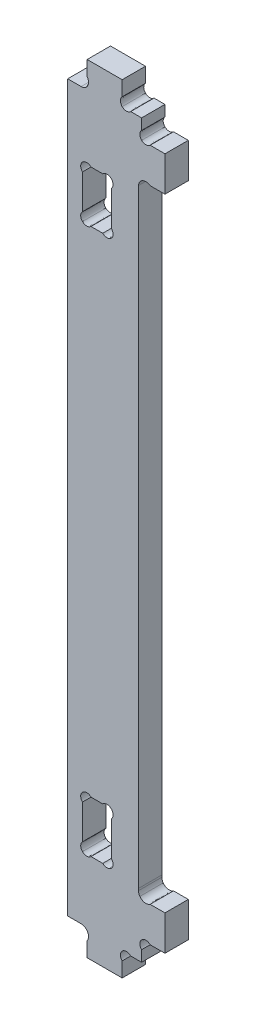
ISO-10303-21;
HEADER;
FILE_DESCRIPTION(('STEP AP214'),'2;1');
FILE_NAME('part.step','',(''),(''),'','','');
FILE_SCHEMA(('AUTOMOTIVE_DESIGN { 1 0 10303 214 1 1 1 1 }'));
ENDSEC;
DATA;
#1=APPLICATION_CONTEXT('core data for automotive mechanical design processes');
#2=APPLICATION_PROTOCOL_DEFINITION('international standard','automotive_design',2000,#1);
#3=PRODUCT_CONTEXT('',#1,'mechanical');
#4=PRODUCT('Part','Part','',(#3));
#5=PRODUCT_RELATED_PRODUCT_CATEGORY('part','',(#4));
#6=PRODUCT_DEFINITION_FORMATION('','',#4);
#7=PRODUCT_DEFINITION_CONTEXT('part definition',#1,'design');
#8=PRODUCT_DEFINITION('design','',#6,#7);
#9=PRODUCT_DEFINITION_SHAPE('','',#8);
#10=(LENGTH_UNIT() NAMED_UNIT(*) SI_UNIT(.MILLI.,.METRE.));
#11=(NAMED_UNIT(*) PLANE_ANGLE_UNIT() SI_UNIT($,.RADIAN.));
#12=(NAMED_UNIT(*) SI_UNIT($,.STERADIAN.) SOLID_ANGLE_UNIT());
#13=UNCERTAINTY_MEASURE_WITH_UNIT(LENGTH_MEASURE(1.E-05),#10,'distance_accuracy_value','');
#14=(GEOMETRIC_REPRESENTATION_CONTEXT(3) GLOBAL_UNCERTAINTY_ASSIGNED_CONTEXT((#13)) GLOBAL_UNIT_ASSIGNED_CONTEXT((#10,
#11,#12)) REPRESENTATION_CONTEXT('',''));
#15=CARTESIAN_POINT('',(0.,0.,0.));
#16=DIRECTION('',(0.,0.,1.));
#17=DIRECTION('',(1.,0.,0.));
#18=AXIS2_PLACEMENT_3D('',#15,#16,#17);
#19=CARTESIAN_POINT('',(2024.18972876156,211.320324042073,6.));
#20=CARTESIAN_POINT('',(2024.41667442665,210.999951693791,6.));
#21=CARTESIAN_POINT('',(2024.53863080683,210.616986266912,6.));
#22=CARTESIAN_POINT('',(2024.53863080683,210.224331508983,6.));
#23=B_SPLINE_CURVE_WITH_KNOTS('',3,(#19,#20,#21,#22),.UNSPECIFIED.,.F.,.F.,(4,4),(35.,36.),.UNSPECIFIED.);
#24=DIRECTION('',(0.,0.,-1.));
#25=VECTOR('',#24,1.);
#26=SURFACE_OF_LINEAR_EXTRUSION('',#23,#25);
#27=CARTESIAN_POINT('',(2024.18972876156,211.320324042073,0.));
#28=CARTESIAN_POINT('',(2024.41667442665,210.999951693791,0.));
#29=CARTESIAN_POINT('',(2024.53863080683,210.616986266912,0.));
#30=CARTESIAN_POINT('',(2024.53863080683,210.224331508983,0.));
#31=B_SPLINE_CURVE_WITH_KNOTS('',3,(#27,#28,#29,#30),.UNSPECIFIED.,.F.,.F.,(4,4),(35.,36.),.UNSPECIFIED.);
#32=CARTESIAN_POINT('',(2024.18972876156,211.320324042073,0.));
#33=VERTEX_POINT('',#32);
#34=CARTESIAN_POINT('',(2024.53863080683,210.224331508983,0.));
#35=VERTEX_POINT('',#34);
#36=EDGE_CURVE('E625',#33,#35,#31,.T.);
#37=ORIENTED_EDGE('',*,*,#36,.T.);
#38=DIRECTION('',(0.,0.,-1.));
#39=VECTOR('',#38,1.);
#40=CARTESIAN_POINT('',(2024.53863080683,210.224331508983,6.));
#41=LINE('',#40,#39);
#42=CARTESIAN_POINT('',(2024.53863080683,210.224331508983,6.));
#43=VERTEX_POINT('',#42);
#44=EDGE_CURVE('E11',#43,#35,#41,.T.);
#45=ORIENTED_EDGE('',*,*,#44,.F.);
#46=CARTESIAN_POINT('',(2024.18972876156,211.320324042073,6.));
#47=VERTEX_POINT('',#46);
#48=EDGE_CURVE('E1104',#47,#43,#23,.T.);
#49=ORIENTED_EDGE('',*,*,#48,.F.);
#50=DIRECTION('',(0.,0.,-1.));
#51=VECTOR('',#50,1.);
#52=CARTESIAN_POINT('',(2024.18972876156,211.320324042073,6.));
#53=LINE('',#52,#51);
#54=EDGE_CURVE('E784',#47,#33,#53,.T.);
#55=ORIENTED_EDGE('',*,*,#54,.T.);
#56=EDGE_LOOP('',(#37,#45,#49,#55));
#57=FACE_BOUND('',#56,.T.);
#58=ADVANCED_FACE('F36',(#57),#26,.F.);
#59=CARTESIAN_POINT('',(2024.53863080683,210.224331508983,6.));
#60=CARTESIAN_POINT('',(2024.53871693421,209.177194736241,6.));
#61=CARTESIAN_POINT('',(2023.68984540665,208.328258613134,6.));
#62=CARTESIAN_POINT('',(2022.64270863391,208.328215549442,6.));
#63=B_SPLINE_CURVE_WITH_KNOTS('',3,(#59,#60,#61,#62),.UNSPECIFIED.,.F.,.F.,(4,4),(36.,37.),.UNSPECIFIED.);
#64=DIRECTION('',(0.,0.,-1.));
#65=VECTOR('',#64,1.);
#66=SURFACE_OF_LINEAR_EXTRUSION('',#63,#65);
#67=CARTESIAN_POINT('',(2024.53863080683,210.224331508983,0.));
#68=CARTESIAN_POINT('',(2024.53871693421,209.177194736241,0.));
#69=CARTESIAN_POINT('',(2023.68984540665,208.328258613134,0.));
#70=CARTESIAN_POINT('',(2022.64270863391,208.328215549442,0.));
#71=B_SPLINE_CURVE_WITH_KNOTS('',3,(#67,#68,#69,#70),.UNSPECIFIED.,.F.,.F.,(4,4),(36.,37.),.UNSPECIFIED.);
#72=CARTESIAN_POINT('',(2022.64270863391,208.328215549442,0.));
#73=VERTEX_POINT('',#72);
#74=EDGE_CURVE('E630',#35,#73,#71,.T.);
#75=ORIENTED_EDGE('',*,*,#74,.T.);
#76=DIRECTION('',(0.,0.,-1.));
#77=VECTOR('',#76,1.);
#78=CARTESIAN_POINT('',(2022.64270863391,208.328215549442,6.));
#79=LINE('',#78,#77);
#80=CARTESIAN_POINT('',(2022.64270863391,208.328215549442,6.));
#81=VERTEX_POINT('',#80);
#82=EDGE_CURVE('E47',#81,#73,#79,.T.);
#83=ORIENTED_EDGE('',*,*,#82,.F.);
#84=EDGE_CURVE('E1109',#43,#81,#63,.T.);
#85=ORIENTED_EDGE('',*,*,#84,.F.);
#86=ORIENTED_EDGE('',*,*,#44,.T.);
#87=EDGE_LOOP('',(#75,#83,#85,#86));
#88=FACE_BOUND('',#87,.T.);
#89=ADVANCED_FACE('F1090',(#88),#66,.F.);
#90=CARTESIAN_POINT('',(-0.0129834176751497,208.202083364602,6.));
#91=DIRECTION('',(6.23596913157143E-05,-0.999999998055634,0.));
#92=DIRECTION('',(0.999999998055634,6.23596913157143E-05,0.));
#93=AXIS2_PLACEMENT_3D('',#90,#91,#92);
#94=PLANE('',#93);
#95=DIRECTION('',(-0.999999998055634,-6.23596913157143E-05,0.));
#96=VECTOR('',#95,1.);
#97=CARTESIAN_POINT('',(-0.0129834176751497,208.202083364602,0.));
#98=LINE('',#97,#96);
#99=CARTESIAN_POINT('',(2019.18986168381,208.328000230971,0.));
#100=VERTEX_POINT('',#99);
#101=EDGE_CURVE('E637',#73,#100,#98,.T.);
#102=ORIENTED_EDGE('',*,*,#101,.T.);
#103=DIRECTION('',(0.,0.,-1.));
#104=VECTOR('',#103,1.);
#105=CARTESIAN_POINT('',(2019.18986168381,208.328000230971,6.));
#106=LINE('',#105,#104);
#107=CARTESIAN_POINT('',(2019.18986168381,208.328000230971,6.));
#108=VERTEX_POINT('',#107);
#109=EDGE_CURVE('E888',#108,#100,#106,.T.);
#110=ORIENTED_EDGE('',*,*,#109,.F.);
#111=DIRECTION('',(-0.999999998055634,-6.23596913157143E-05,0.));
#112=VECTOR('',#111,1.);
#113=CARTESIAN_POINT('',(-0.0129834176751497,208.202083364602,6.));
#114=LINE('',#113,#112);
#115=EDGE_CURVE('E1119',#81,#108,#114,.T.);
#116=ORIENTED_EDGE('',*,*,#115,.F.);
#117=ORIENTED_EDGE('',*,*,#82,.T.);
#118=EDGE_LOOP('',(#102,#110,#116,#117));
#119=FACE_BOUND('',#118,.T.);
#120=ADVANCED_FACE('F1096',(#119),#94,.F.);
#121=CARTESIAN_POINT('',(2019.20365497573,0.133776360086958,6.));
#122=DIRECTION('',(0.999999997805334,6.62520392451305E-05,0.));
#123=DIRECTION('',(-6.62520392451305E-05,0.999999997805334,0.));
#124=AXIS2_PLACEMENT_3D('',#121,#122,#123);
#125=PLANE('',#124);
#126=DIRECTION('',(6.62520392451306E-05,-0.999999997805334,0.));
#127=VECTOR('',#126,1.);
#128=CARTESIAN_POINT('',(2019.20365497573,0.133776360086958,0.));
#129=LINE('',#128,#127);
#130=CARTESIAN_POINT('',(2019.19020619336,203.128016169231,0.));
#131=VERTEX_POINT('',#130);
#132=EDGE_CURVE('E642',#100,#131,#129,.T.);
#133=ORIENTED_EDGE('',*,*,#132,.T.);
#134=DIRECTION('',(0.,0.,-1.));
#135=VECTOR('',#134,1.);
#136=CARTESIAN_POINT('',(2019.19020619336,203.128016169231,6.));
#137=LINE('',#136,#135);
#138=CARTESIAN_POINT('',(2019.19020619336,203.128016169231,6.));
#139=VERTEX_POINT('',#138);
#140=EDGE_CURVE('E885',#139,#131,#137,.T.);
#141=ORIENTED_EDGE('',*,*,#140,.F.);
#142=DIRECTION('',(6.62520392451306E-05,-0.999999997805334,0.));
#143=VECTOR('',#142,1.);
#144=CARTESIAN_POINT('',(2019.20365497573,0.133776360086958,6.));
#145=LINE('',#144,#143);
#146=EDGE_CURVE('E1124',#108,#139,#145,.T.);
#147=ORIENTED_EDGE('',*,*,#146,.F.);
#148=ORIENTED_EDGE('',*,*,#109,.T.);
#149=EDGE_LOOP('',(#133,#141,#147,#148));
#150=FACE_BOUND('',#149,.T.);
#151=ADVANCED_FACE('F1164',(#150),#125,.F.);
#152=CARTESIAN_POINT('',(2019.19020619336,0.,6.));
#153=DIRECTION('',(1.,0.,0.));
#154=DIRECTION('',(0.,0.,-1.));
#155=AXIS2_PLACEMENT_3D('',#152,#153,#154);
#156=PLANE('',#155);
#157=DIRECTION('',(0.,-1.,0.));
#158=VECTOR('',#157,1.);
#159=CARTESIAN_POINT('',(2019.19020619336,0.,0.));
#160=LINE('',#159,#158);
#161=CARTESIAN_POINT('',(2019.19020619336,27.1291121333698,0.));
#162=VERTEX_POINT('',#161);
#163=EDGE_CURVE('E644',#131,#162,#160,.T.);
#164=ORIENTED_EDGE('',*,*,#163,.T.);
#165=DIRECTION('',(0.,0.,-1.));
#166=VECTOR('',#165,1.);
#167=CARTESIAN_POINT('',(2019.19020619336,27.1291121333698,6.));
#168=LINE('',#167,#166);
#169=CARTESIAN_POINT('',(2019.19020619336,27.1291121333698,6.));
#170=VERTEX_POINT('',#169);
#171=EDGE_CURVE('E882',#170,#162,#168,.T.);
#172=ORIENTED_EDGE('',*,*,#171,.F.);
#173=DIRECTION('',(0.,-1.,0.));
#174=VECTOR('',#173,1.);
#175=CARTESIAN_POINT('',(2019.19020619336,0.,6.));
#176=LINE('',#175,#174);
#177=EDGE_CURVE('E1126',#139,#170,#176,.T.);
#178=ORIENTED_EDGE('',*,*,#177,.F.);
#179=ORIENTED_EDGE('',*,*,#140,.T.);
#180=EDGE_LOOP('',(#164,#172,#178,#179));
#181=FACE_BOUND('',#180,.T.);
#182=ADVANCED_FACE('F1160',(#181),#156,.F.);
#183=CARTESIAN_POINT('',(2019.18839997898,-0.133774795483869,6.));
#184=DIRECTION('',(0.999999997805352,-6.62517649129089E-05,0.));
#185=DIRECTION('',(6.62517649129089E-05,0.999999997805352,0.));
#186=AXIS2_PLACEMENT_3D('',#183,#184,#185);
#187=PLANE('',#186);
#188=DIRECTION('',(-6.62517649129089E-05,-0.999999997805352,0.));
#189=VECTOR('',#188,1.);
#190=CARTESIAN_POINT('',(2019.18839997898,-0.133774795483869,0.));
#191=LINE('',#190,#189);
#192=CARTESIAN_POINT('',(2019.18986168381,21.9291065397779,0.));
#193=VERTEX_POINT('',#192);
#194=EDGE_CURVE('E646',#162,#193,#191,.T.);
#195=ORIENTED_EDGE('',*,*,#194,.T.);
#196=DIRECTION('',(0.,0.,-1.));
#197=VECTOR('',#196,1.);
#198=CARTESIAN_POINT('',(2019.18986168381,21.9291065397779,6.));
#199=LINE('',#198,#197);
#200=CARTESIAN_POINT('',(2019.18986168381,21.9291065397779,6.));
#201=VERTEX_POINT('',#200);
#202=EDGE_CURVE('E879',#201,#193,#199,.T.);
#203=ORIENTED_EDGE('',*,*,#202,.F.);
#204=DIRECTION('',(-6.62517649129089E-05,-0.999999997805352,0.));
#205=VECTOR('',#204,1.);
#206=CARTESIAN_POINT('',(2019.18839997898,-0.133774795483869,6.));
#207=LINE('',#206,#205);
#208=EDGE_CURVE('E1128',#170,#201,#207,.T.);
#209=ORIENTED_EDGE('',*,*,#208,.F.);
#210=ORIENTED_EDGE('',*,*,#171,.T.);
#211=EDGE_LOOP('',(#195,#203,#209,#210));
#212=FACE_BOUND('',#211,.T.);
#213=ADVANCED_FACE('F1156',(#212),#187,.F.);
#214=CARTESIAN_POINT('',(0.00123710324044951,22.0424309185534,6.));
#215=DIRECTION('',(5.61237207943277E-05,0.999999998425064,0.));
#216=DIRECTION('',(-0.999999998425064,5.61237207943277E-05,0.));
#217=AXIS2_PLACEMENT_3D('',#214,#215,#216);
#218=PLANE('',#217);
#219=DIRECTION('',(0.999999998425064,-5.61237207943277E-05,0.));
#220=VECTOR('',#219,1.);
#221=CARTESIAN_POINT('',(0.00123710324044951,22.0424309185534,0.));
#222=LINE('',#221,#220);
#223=CARTESIAN_POINT('',(2022.64270863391,21.9289127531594,0.));
#224=VERTEX_POINT('',#223);
#225=EDGE_CURVE('E648',#193,#224,#222,.T.);
#226=ORIENTED_EDGE('',*,*,#225,.T.);
#227=DIRECTION('',(0.,0.,-1.));
#228=VECTOR('',#227,1.);
#229=CARTESIAN_POINT('',(2022.64270863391,21.9289127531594,6.));
#230=LINE('',#229,#228);
#231=CARTESIAN_POINT('',(2022.64270863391,21.9289127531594,6.));
#232=VERTEX_POINT('',#231);
#233=EDGE_CURVE('E876',#232,#224,#230,.T.);
#234=ORIENTED_EDGE('',*,*,#233,.F.);
#235=DIRECTION('',(0.999999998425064,-5.61237207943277E-05,0.));
#236=VECTOR('',#235,1.);
#237=CARTESIAN_POINT('',(0.00123710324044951,22.0424309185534,6.));
#238=LINE('',#237,#236);
#239=EDGE_CURVE('E1130',#201,#232,#238,.T.);
#240=ORIENTED_EDGE('',*,*,#239,.F.);
#241=ORIENTED_EDGE('',*,*,#202,.T.);
#242=EDGE_LOOP('',(#226,#234,#240,#241));
#243=FACE_BOUND('',#242,.T.);
#244=ADVANCED_FACE('F1151',(#243),#218,.F.);
#245=CARTESIAN_POINT('',(2022.64270863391,21.9289127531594,6.));
#246=CARTESIAN_POINT('',(2023.68984540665,21.9288481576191,6.));
#247=CARTESIAN_POINT('',(2024.53871693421,21.0799120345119,6.));
#248=CARTESIAN_POINT('',(2024.53863080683,20.0327752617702,6.));
#249=B_SPLINE_CURVE_WITH_KNOTS('',3,(#245,#246,#247,#248),.UNSPECIFIED.,.F.,.F.,(4,4),(2.,3.),.UNSPECIFIED.);
#250=DIRECTION('',(0.,0.,-1.));
#251=VECTOR('',#250,1.);
#252=SURFACE_OF_LINEAR_EXTRUSION('',#249,#251);
#253=CARTESIAN_POINT('',(2022.64270863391,21.9289127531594,0.));
#254=CARTESIAN_POINT('',(2023.68984540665,21.9288481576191,0.));
#255=CARTESIAN_POINT('',(2024.53871693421,21.0799120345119,0.));
#256=CARTESIAN_POINT('',(2024.53863080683,20.0327752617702,0.));
#257=B_SPLINE_CURVE_WITH_KNOTS('',3,(#253,#254,#255,#256),.UNSPECIFIED.,.F.,.F.,(4,4),(2.,3.),.UNSPECIFIED.);
#258=CARTESIAN_POINT('',(2024.53863080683,20.0327752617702,0.));
#259=VERTEX_POINT('',#258);
#260=EDGE_CURVE('E650',#224,#259,#257,.T.);
#261=ORIENTED_EDGE('',*,*,#260,.T.);
#262=DIRECTION('',(0.,0.,-1.));
#263=VECTOR('',#262,1.);
#264=CARTESIAN_POINT('',(2024.53863080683,20.0327752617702,6.));
#265=LINE('',#264,#263);
#266=CARTESIAN_POINT('',(2024.53863080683,20.0327752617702,6.));
#267=VERTEX_POINT('',#266);
#268=EDGE_CURVE('E873',#267,#259,#265,.T.);
#269=ORIENTED_EDGE('',*,*,#268,.F.);
#270=EDGE_CURVE('E1132',#232,#267,#249,.T.);
#271=ORIENTED_EDGE('',*,*,#270,.F.);
#272=ORIENTED_EDGE('',*,*,#233,.T.);
#273=EDGE_LOOP('',(#261,#269,#271,#272));
#274=FACE_BOUND('',#273,.T.);
#275=ADVANCED_FACE('F1146',(#274),#252,.F.);
#276=CARTESIAN_POINT('',(2024.53863080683,20.0327752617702,6.));
#277=CARTESIAN_POINT('',(2024.53863080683,19.6401205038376,6.));
#278=CARTESIAN_POINT('',(2024.41667442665,19.2571766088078,6.));
#279=CARTESIAN_POINT('',(2024.18972876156,18.9367827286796,6.));
#280=B_SPLINE_CURVE_WITH_KNOTS('',3,(#276,#277,#278,#279),.UNSPECIFIED.,.F.,.F.,(4,4),(3.,4.),.UNSPECIFIED.);
#281=DIRECTION('',(0.,0.,-1.));
#282=VECTOR('',#281,1.);
#283=SURFACE_OF_LINEAR_EXTRUSION('',#280,#282);
#284=CARTESIAN_POINT('',(2024.53863080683,20.0327752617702,0.));
#285=CARTESIAN_POINT('',(2024.53863080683,19.6401205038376,0.));
#286=CARTESIAN_POINT('',(2024.41667442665,19.2571766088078,0.));
#287=CARTESIAN_POINT('',(2024.18972876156,18.9367827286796,0.));
#288=B_SPLINE_CURVE_WITH_KNOTS('',3,(#284,#285,#286,#287),.UNSPECIFIED.,.F.,.F.,(4,4),(3.,4.),.UNSPECIFIED.);
#289=CARTESIAN_POINT('',(2024.18972876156,18.9367827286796,0.));
#290=VERTEX_POINT('',#289);
#291=EDGE_CURVE('E654',#259,#290,#288,.T.);
#292=ORIENTED_EDGE('',*,*,#291,.T.);
#293=DIRECTION('',(0.,0.,-1.));
#294=VECTOR('',#293,1.);
#295=CARTESIAN_POINT('',(2024.18972876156,18.9367827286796,6.));
#296=LINE('',#295,#294);
#297=CARTESIAN_POINT('',(2024.18972876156,18.9367827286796,6.));
#298=VERTEX_POINT('',#297);
#299=EDGE_CURVE('E870',#298,#290,#296,.T.);
#300=ORIENTED_EDGE('',*,*,#299,.F.);
#301=EDGE_CURVE('E1137',#267,#298,#280,.T.);
#302=ORIENTED_EDGE('',*,*,#301,.F.);
#303=ORIENTED_EDGE('',*,*,#268,.T.);
#304=EDGE_LOOP('',(#292,#300,#302,#303));
#305=FACE_BOUND('',#304,.T.);
#306=ADVANCED_FACE('F1150',(#305),#283,.F.);
#307=CARTESIAN_POINT('',(2024.18843452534,-0.137347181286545,6.));
#308=DIRECTION('',(0.999999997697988,-6.78529620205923E-05,0.));
#309=DIRECTION('',(6.78529620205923E-05,0.999999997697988,0.));
#310=AXIS2_PLACEMENT_3D('',#307,#308,#309);
#311=PLANE('',#310);
#312=DIRECTION('',(-6.78529620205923E-05,-0.999999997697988,0.));
#313=VECTOR('',#312,1.);
#314=CARTESIAN_POINT('',(2024.18843452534,-0.137347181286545,0.));
#315=LINE('',#314,#313);
#316=CARTESIAN_POINT('',(2024.1894703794,15.128811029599,0.));
#317=VERTEX_POINT('',#316);
#318=EDGE_CURVE('E661',#290,#317,#315,.T.);
#319=ORIENTED_EDGE('',*,*,#318,.T.);
#320=DIRECTION('',(0.,0.,-1.));
#321=VECTOR('',#320,1.);
#322=CARTESIAN_POINT('',(2024.1894703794,15.128811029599,6.));
#323=LINE('',#322,#321);
#324=CARTESIAN_POINT('',(2024.1894703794,15.128811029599,6.));
#325=VERTEX_POINT('',#324);
#326=EDGE_CURVE('E867',#325,#317,#323,.T.);
#327=ORIENTED_EDGE('',*,*,#326,.F.);
#328=DIRECTION('',(-6.78529620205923E-05,-0.999999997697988,0.));
#329=VECTOR('',#328,1.);
#330=CARTESIAN_POINT('',(2024.18843452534,-0.137347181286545,6.));
#331=LINE('',#330,#329);
#332=EDGE_CURVE('E1430',#298,#325,#331,.T.);
#333=ORIENTED_EDGE('',*,*,#332,.F.);
#334=ORIENTED_EDGE('',*,*,#299,.T.);
#335=EDGE_LOOP('',(#319,#327,#333,#334));
#336=FACE_BOUND('',#335,.T.);
#337=ADVANCED_FACE('F1427',(#336),#311,.F.);
#338=CARTESIAN_POINT('',(0.000875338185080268,15.2450357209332,6.));
#339=DIRECTION('',(5.74179162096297E-05,0.999999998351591,0.));
#340=DIRECTION('',(-0.999999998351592,5.74179162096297E-05,0.));
#341=AXIS2_PLACEMENT_3D('',#338,#339,#340);
#342=PLANE('',#341);
#343=DIRECTION('',(0.999999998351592,-5.74179162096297E-05,0.));
#344=VECTOR('',#343,1.);
#345=CARTESIAN_POINT('',(0.000875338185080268,15.2450357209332,0.));
#346=LINE('',#345,#344);
#347=CARTESIAN_POINT('',(2033.18952395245,15.1282942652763,0.));
#348=VERTEX_POINT('',#347);
#349=EDGE_CURVE('E666',#317,#348,#346,.T.);
#350=ORIENTED_EDGE('',*,*,#349,.T.);
#351=DIRECTION('',(0.,0.,-1.));
#352=VECTOR('',#351,1.);
#353=CARTESIAN_POINT('',(2033.18952395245,15.1282942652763,6.));
#354=LINE('',#353,#352);
#355=CARTESIAN_POINT('',(2033.18952395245,15.1282942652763,6.));
#356=VERTEX_POINT('',#355);
#357=EDGE_CURVE('E864',#356,#348,#354,.T.);
#358=ORIENTED_EDGE('',*,*,#357,.F.);
#359=DIRECTION('',(0.999999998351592,-5.74179162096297E-05,0.));
#360=VECTOR('',#359,1.);
#361=CARTESIAN_POINT('',(0.000875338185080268,15.2450357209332,6.));
#362=LINE('',#361,#360);
#363=EDGE_CURVE('E1421',#325,#356,#362,.T.);
#364=ORIENTED_EDGE('',*,*,#363,.F.);
#365=ORIENTED_EDGE('',*,*,#326,.T.);
#366=EDGE_LOOP('',(#350,#358,#364,#365));
#367=FACE_BOUND('',#366,.T.);
#368=ADVANCED_FACE('F1420',(#367),#342,.F.);
#369=CARTESIAN_POINT('',(2033.18883545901,-0.0919719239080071,6.));
#370=DIRECTION('',(-0.999999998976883,4.52353083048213E-05,0.));
#371=DIRECTION('',(-4.52353083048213E-05,-0.999999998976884,0.));
#372=AXIS2_PLACEMENT_3D('',#369,#370,#371);
#373=PLANE('',#372);
#374=DIRECTION('',(4.52353083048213E-05,0.999999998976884,0.));
#375=VECTOR('',#374,1.);
#376=CARTESIAN_POINT('',(2033.18883545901,-0.0919719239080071,0.));
#377=LINE('',#376,#375);
#378=CARTESIAN_POINT('',(2033.18969620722,18.9362659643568,0.));
#379=VERTEX_POINT('',#378);
#380=EDGE_CURVE('E668',#348,#379,#377,.T.);
#381=ORIENTED_EDGE('',*,*,#380,.T.);
#382=DIRECTION('',(0.,0.,-1.));
#383=VECTOR('',#382,1.);
#384=CARTESIAN_POINT('',(2033.18969620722,18.9362659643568,6.));
#385=LINE('',#384,#383);
#386=CARTESIAN_POINT('',(2033.18969620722,18.9362659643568,6.));
#387=VERTEX_POINT('',#386);
#388=EDGE_CURVE('E861',#387,#379,#385,.T.);
#389=ORIENTED_EDGE('',*,*,#388,.F.);
#390=DIRECTION('',(4.52353083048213E-05,0.999999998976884,0.));
#391=VECTOR('',#390,1.);
#392=CARTESIAN_POINT('',(2033.18883545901,-0.0919719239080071,6.));
#393=LINE('',#392,#391);
#394=EDGE_CURVE('E1416',#356,#387,#393,.T.);
#395=ORIENTED_EDGE('',*,*,#394,.F.);
#396=ORIENTED_EDGE('',*,*,#357,.T.);
#397=EDGE_LOOP('',(#381,#389,#395,#396));
#398=FACE_BOUND('',#397,.T.);
#399=ADVANCED_FACE('F1415',(#398),#373,.F.);
#400=CARTESIAN_POINT('',(2033.18969620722,18.9362659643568,6.));
#401=CARTESIAN_POINT('',(2032.58439293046,19.5416123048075,6.));
#402=CARTESIAN_POINT('',(2032.58447905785,20.5230123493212,6.));
#403=CARTESIAN_POINT('',(2033.189868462,21.1282940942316,6.));
#404=B_SPLINE_CURVE_WITH_KNOTS('',3,(#400,#401,#402,#403),.UNSPECIFIED.,.F.,.F.,(4,4),(7.,8.),.UNSPECIFIED.);
#405=DIRECTION('',(0.,0.,-1.));
#406=VECTOR('',#405,1.);
#407=SURFACE_OF_LINEAR_EXTRUSION('',#404,#406);
#408=CARTESIAN_POINT('',(2033.18969620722,18.9362659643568,0.));
#409=CARTESIAN_POINT('',(2032.58439293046,19.5416123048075,0.));
#410=CARTESIAN_POINT('',(2032.58447905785,20.5230123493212,0.));
#411=CARTESIAN_POINT('',(2033.189868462,21.1282940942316,0.));
#412=B_SPLINE_CURVE_WITH_KNOTS('',3,(#408,#409,#410,#411),.UNSPECIFIED.,.F.,.F.,(4,4),(7.,8.),.UNSPECIFIED.);
#413=CARTESIAN_POINT('',(2033.189868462,21.1282940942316,0.));
#414=VERTEX_POINT('',#413);
#415=EDGE_CURVE('E670',#379,#414,#412,.T.);
#416=ORIENTED_EDGE('',*,*,#415,.T.);
#417=DIRECTION('',(0.,0.,-1.));
#418=VECTOR('',#417,1.);
#419=CARTESIAN_POINT('',(2033.189868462,21.1282940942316,6.));
#420=LINE('',#419,#418);
#421=CARTESIAN_POINT('',(2033.189868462,21.1282940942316,6.));
#422=VERTEX_POINT('',#421);
#423=EDGE_CURVE('E858',#422,#414,#420,.T.);
#424=ORIENTED_EDGE('',*,*,#423,.F.);
#425=EDGE_CURVE('E1412',#387,#422,#404,.T.);
#426=ORIENTED_EDGE('',*,*,#425,.F.);
#427=ORIENTED_EDGE('',*,*,#388,.T.);
#428=EDGE_LOOP('',(#416,#424,#426,#427));
#429=FACE_BOUND('',#428,.T.);
#430=ADVANCED_FACE('F1409',(#429),#407,.F.);
#431=CARTESIAN_POINT('',(2033.189868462,21.1282940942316,6.));
#432=CARTESIAN_POINT('',(2033.79517173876,21.7335758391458,6.));
#433=CARTESIAN_POINT('',(2034.77659331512,21.7335112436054,6.));
#434=CARTESIAN_POINT('',(2035.38181046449,21.1281649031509,6.));
#435=B_SPLINE_CURVE_WITH_KNOTS('',3,(#431,#432,#433,#434),.UNSPECIFIED.,.F.,.F.,(4,4),(8.,9.),.UNSPECIFIED.);
#436=DIRECTION('',(0.,0.,-1.));
#437=VECTOR('',#436,1.);
#438=SURFACE_OF_LINEAR_EXTRUSION('',#435,#437);
#439=CARTESIAN_POINT('',(2033.189868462,21.1282940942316,0.));
#440=CARTESIAN_POINT('',(2033.79517173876,21.7335758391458,0.));
#441=CARTESIAN_POINT('',(2034.77659331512,21.7335112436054,0.));
#442=CARTESIAN_POINT('',(2035.38181046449,21.1281649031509,0.));
#443=B_SPLINE_CURVE_WITH_KNOTS('',3,(#439,#440,#441,#442),.UNSPECIFIED.,.F.,.F.,(4,4),(8.,9.),.UNSPECIFIED.);
#444=CARTESIAN_POINT('',(2035.38181046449,21.1281649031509,0.));
#445=VERTEX_POINT('',#444);
#446=EDGE_CURVE('E674',#414,#445,#443,.T.);
#447=ORIENTED_EDGE('',*,*,#446,.T.);
#448=DIRECTION('',(0.,0.,-1.));
#449=VECTOR('',#448,1.);
#450=CARTESIAN_POINT('',(2035.38181046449,21.1281649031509,6.));
#451=LINE('',#450,#449);
#452=CARTESIAN_POINT('',(2035.38181046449,21.1281649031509,6.));
#453=VERTEX_POINT('',#452);
#454=EDGE_CURVE('E855',#453,#445,#451,.T.);
#455=ORIENTED_EDGE('',*,*,#454,.F.);
#456=EDGE_CURVE('E1403',#422,#453,#435,.T.);
#457=ORIENTED_EDGE('',*,*,#456,.F.);
#458=ORIENTED_EDGE('',*,*,#423,.T.);
#459=EDGE_LOOP('',(#447,#455,#457,#458));
#460=FACE_BOUND('',#459,.T.);
#461=ADVANCED_FACE('F1402',(#460),#438,.F.);
#462=CARTESIAN_POINT('',(0.00113994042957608,21.2374160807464,6.));
#463=DIRECTION('',(5.36760415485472E-05,0.999999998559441,0.));
#464=DIRECTION('',(-0.999999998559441,5.36760415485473E-05,0.));
#465=AXIS2_PLACEMENT_3D('',#462,#463,#464);
#466=PLANE('',#465);
#467=DIRECTION('',(0.999999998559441,-5.36760415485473E-05,0.));
#468=VECTOR('',#467,1.);
#469=CARTESIAN_POINT('',(0.00113994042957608,21.2374160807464,0.));
#470=LINE('',#469,#468);
#471=CARTESIAN_POINT('',(2038.18982166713,21.1280141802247,0.));
#472=VERTEX_POINT('',#471);
#473=EDGE_CURVE('E681',#445,#472,#470,.T.);
#474=ORIENTED_EDGE('',*,*,#473,.T.);
#475=DIRECTION('',(0.,0.,-1.));
#476=VECTOR('',#475,1.);
#477=CARTESIAN_POINT('',(2038.18982166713,21.1280141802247,6.));
#478=LINE('',#477,#476);
#479=CARTESIAN_POINT('',(2038.18982166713,21.1280141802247,6.));
#480=VERTEX_POINT('',#479);
#481=EDGE_CURVE('E852',#480,#472,#478,.T.);
#482=ORIENTED_EDGE('',*,*,#481,.F.);
#483=DIRECTION('',(0.999999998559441,-5.36760415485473E-05,0.));
#484=VECTOR('',#483,1.);
#485=CARTESIAN_POINT('',(0.00113994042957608,21.2374160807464,6.));
#486=LINE('',#485,#484);
#487=EDGE_CURVE('E1398',#453,#480,#486,.T.);
#488=ORIENTED_EDGE('',*,*,#487,.F.);
#489=ORIENTED_EDGE('',*,*,#454,.T.);
#490=EDGE_LOOP('',(#474,#482,#488,#489));
#491=FACE_BOUND('',#490,.T.);
#492=ADVANCED_FACE('F1397',(#491),#466,.F.);
#493=CARTESIAN_POINT('',(2038.18851789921,-0.125032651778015,6.));
#494=DIRECTION('',(-0.999999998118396,6.1344988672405E-05,0.));
#495=DIRECTION('',(-6.1344988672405E-05,-0.999999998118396,0.));
#496=AXIS2_PLACEMENT_3D('',#493,#494,#495);
#497=PLANE('',#496);
#498=DIRECTION('',(6.1344988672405E-05,0.999999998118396,0.));
#499=VECTOR('',#498,1.);
#500=CARTESIAN_POINT('',(2038.18851789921,-0.125032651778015,0.));
#501=LINE('',#500,#499);
#502=CARTESIAN_POINT('',(2038.1899939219,23.9359823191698,0.));
#503=VERTEX_POINT('',#502);
#504=EDGE_CURVE('E686',#472,#503,#501,.T.);
#505=ORIENTED_EDGE('',*,*,#504,.T.);
#506=DIRECTION('',(0.,0.,-1.));
#507=VECTOR('',#506,1.);
#508=CARTESIAN_POINT('',(2038.1899939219,23.9359823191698,6.));
#509=LINE('',#508,#507);
#510=CARTESIAN_POINT('',(2038.1899939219,23.9359823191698,6.));
#511=VERTEX_POINT('',#510);
#512=EDGE_CURVE('E849',#511,#503,#509,.T.);
#513=ORIENTED_EDGE('',*,*,#512,.F.);
#514=DIRECTION('',(6.1344988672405E-05,0.999999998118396,0.));
#515=VECTOR('',#514,1.);
#516=CARTESIAN_POINT('',(2038.18851789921,-0.125032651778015,6.));
#517=LINE('',#516,#515);
#518=EDGE_CURVE('E1394',#480,#511,#517,.T.);
#519=ORIENTED_EDGE('',*,*,#518,.F.);
#520=ORIENTED_EDGE('',*,*,#481,.T.);
#521=EDGE_LOOP('',(#505,#513,#519,#520));
#522=FACE_BOUND('',#521,.T.);
#523=ADVANCED_FACE('F1391',(#522),#497,.F.);
#524=CARTESIAN_POINT('',(2038.1899939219,23.9359823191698,6.));
#525=CARTESIAN_POINT('',(2037.58469064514,24.5413286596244,6.));
#526=CARTESIAN_POINT('',(2037.58477677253,25.5227287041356,6.));
#527=CARTESIAN_POINT('',(2038.19008004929,26.1280104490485,6.));
#528=B_SPLINE_CURVE_WITH_KNOTS('',3,(#524,#525,#526,#527),.UNSPECIFIED.,.F.,.F.,(4,4),(11.,12.),.UNSPECIFIED.);
#529=DIRECTION('',(0.,0.,-1.));
#530=VECTOR('',#529,1.);
#531=SURFACE_OF_LINEAR_EXTRUSION('',#528,#530);
#532=CARTESIAN_POINT('',(2038.1899939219,23.9359823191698,0.));
#533=CARTESIAN_POINT('',(2037.58469064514,24.5413286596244,0.));
#534=CARTESIAN_POINT('',(2037.58477677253,25.5227287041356,0.));
#535=CARTESIAN_POINT('',(2038.19008004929,26.1280104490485,0.));
#536=B_SPLINE_CURVE_WITH_KNOTS('',3,(#532,#533,#534,#535),.UNSPECIFIED.,.F.,.F.,(4,4),(11.,12.),.UNSPECIFIED.);
#537=CARTESIAN_POINT('',(2038.19008004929,26.1280104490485,0.));
#538=VERTEX_POINT('',#537);
#539=EDGE_CURVE('E688',#503,#538,#536,.T.);
#540=ORIENTED_EDGE('',*,*,#539,.T.);
#541=DIRECTION('',(0.,0.,-1.));
#542=VECTOR('',#541,1.);
#543=CARTESIAN_POINT('',(2038.19008004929,26.1280104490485,6.));
#544=LINE('',#543,#542);
#545=CARTESIAN_POINT('',(2038.19008004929,26.1280104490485,6.));
#546=VERTEX_POINT('',#545);
#547=EDGE_CURVE('E846',#546,#538,#544,.T.);
#548=ORIENTED_EDGE('',*,*,#547,.F.);
#549=EDGE_CURVE('E1385',#511,#546,#528,.T.);
#550=ORIENTED_EDGE('',*,*,#549,.F.);
#551=ORIENTED_EDGE('',*,*,#512,.T.);
#552=EDGE_LOOP('',(#540,#548,#550,#551));
#553=FACE_BOUND('',#552,.T.);
#554=ADVANCED_FACE('F1384',(#553),#531,.F.);
#555=CARTESIAN_POINT('',(2038.19008004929,26.1280104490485,6.));
#556=CARTESIAN_POINT('',(2038.79546945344,26.7332921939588,6.));
#557=CARTESIAN_POINT('',(2039.7768910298,26.7332275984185,6.));
#558=CARTESIAN_POINT('',(2040.38219430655,26.1278812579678,6.));
#559=B_SPLINE_CURVE_WITH_KNOTS('',3,(#555,#556,#557,#558),.UNSPECIFIED.,.F.,.F.,(4,4),(12.,13.),.UNSPECIFIED.);
#560=DIRECTION('',(0.,0.,-1.));
#561=VECTOR('',#560,1.);
#562=SURFACE_OF_LINEAR_EXTRUSION('',#559,#561);
#563=CARTESIAN_POINT('',(2038.19008004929,26.1280104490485,0.));
#564=CARTESIAN_POINT('',(2038.79546945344,26.7332921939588,0.));
#565=CARTESIAN_POINT('',(2039.7768910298,26.7332275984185,0.));
#566=CARTESIAN_POINT('',(2040.38219430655,26.1278812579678,0.));
#567=B_SPLINE_CURVE_WITH_KNOTS('',3,(#563,#564,#565,#566),.UNSPECIFIED.,.F.,.F.,(4,4),(12.,13.),.UNSPECIFIED.);
#568=CARTESIAN_POINT('',(2040.38219430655,26.1278812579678,0.));
#569=VERTEX_POINT('',#568);
#570=EDGE_CURVE('E692',#538,#569,#567,.T.);
#571=ORIENTED_EDGE('',*,*,#570,.T.);
#572=DIRECTION('',(0.,0.,-1.));
#573=VECTOR('',#572,1.);
#574=CARTESIAN_POINT('',(2040.38219430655,26.1278812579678,6.));
#575=LINE('',#574,#573);
#576=CARTESIAN_POINT('',(2040.38219430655,26.1278812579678,6.));
#577=VERTEX_POINT('',#576);
#578=EDGE_CURVE('E843',#577,#569,#575,.T.);
#579=ORIENTED_EDGE('',*,*,#578,.F.);
#580=EDGE_CURVE('E1380',#546,#577,#559,.T.);
#581=ORIENTED_EDGE('',*,*,#580,.F.);
#582=ORIENTED_EDGE('',*,*,#547,.T.);
#583=EDGE_LOOP('',(#571,#579,#581,#582));
#584=FACE_BOUND('',#583,.T.);
#585=ADVANCED_FACE('F1379',(#584),#562,.F.);
#586=CARTESIAN_POINT('',(0.00148391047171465,26.2432534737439,6.));
#587=DIRECTION('',(5.65444551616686E-05,0.999999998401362,0.));
#588=DIRECTION('',(-0.999999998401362,5.65444551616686E-05,0.));
#589=AXIS2_PLACEMENT_3D('',#586,#587,#588);
#590=PLANE('',#589);
#591=DIRECTION('',(0.999999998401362,-5.65444551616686E-05,0.));
#592=VECTOR('',#591,1.);
#593=CARTESIAN_POINT('',(0.00148391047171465,26.2432534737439,0.));
#594=LINE('',#593,#592);
#595=CARTESIAN_POINT('',(2044.19014447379,26.1276659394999,0.));
#596=VERTEX_POINT('',#595);
#597=EDGE_CURVE('E699',#569,#596,#594,.T.);
#598=ORIENTED_EDGE('',*,*,#597,.T.);
#599=DIRECTION('',(0.,0.,-1.));
#600=VECTOR('',#599,1.);
#601=CARTESIAN_POINT('',(2044.19014447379,26.1276659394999,6.));
#602=LINE('',#601,#600);
#603=CARTESIAN_POINT('',(2044.19014447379,26.1276659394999,6.));
#604=VERTEX_POINT('',#603);
#605=EDGE_CURVE('E840',#604,#596,#602,.T.);
#606=ORIENTED_EDGE('',*,*,#605,.F.);
#607=DIRECTION('',(0.999999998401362,-5.65444551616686E-05,0.));
#608=VECTOR('',#607,1.);
#609=CARTESIAN_POINT('',(0.00148391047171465,26.2432534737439,6.));
#610=LINE('',#609,#608);
#611=EDGE_CURVE('E1376',#577,#604,#610,.T.);
#612=ORIENTED_EDGE('',*,*,#611,.F.);
#613=ORIENTED_EDGE('',*,*,#578,.T.);
#614=EDGE_LOOP('',(#598,#606,#612,#613));
#615=FACE_BOUND('',#614,.T.);
#616=ADVANCED_FACE('F1373',(#615),#590,.F.);
#617=CARTESIAN_POINT('',(2044.18863752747,-0.117373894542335,6.));
#618=DIRECTION('',(-0.999999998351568,5.74183283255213E-05,0.));
#619=DIRECTION('',(-5.74183283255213E-05,-0.999999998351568,0.));
#620=AXIS2_PLACEMENT_3D('',#617,#618,#619);
#621=PLANE('',#620);
#622=DIRECTION('',(5.74183283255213E-05,0.999999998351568,0.));
#623=VECTOR('',#622,1.);
#624=CARTESIAN_POINT('',(2044.18863752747,-0.117373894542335,0.));
#625=LINE('',#624,#623);
#626=CARTESIAN_POINT('',(2044.19066123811,35.1276549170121,0.));
#627=VERTEX_POINT('',#626);
#628=EDGE_CURVE('E704',#596,#627,#625,.T.);
#629=ORIENTED_EDGE('',*,*,#628,.T.);
#630=DIRECTION('',(0.,0.,-1.));
#631=VECTOR('',#630,1.);
#632=CARTESIAN_POINT('',(2044.19066123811,35.1276549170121,6.));
#633=LINE('',#632,#631);
#634=CARTESIAN_POINT('',(2044.19066123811,35.1276549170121,6.));
#635=VERTEX_POINT('',#634);
#636=EDGE_CURVE('E837',#635,#627,#633,.T.);
#637=ORIENTED_EDGE('',*,*,#636,.F.);
#638=DIRECTION('',(5.74183283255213E-05,0.999999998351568,0.));
#639=VECTOR('',#638,1.);
#640=CARTESIAN_POINT('',(2044.18863752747,-0.117373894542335,6.));
#641=LINE('',#640,#639);
#642=EDGE_CURVE('E1367',#604,#635,#641,.T.);
#643=ORIENTED_EDGE('',*,*,#642,.F.);
#644=ORIENTED_EDGE('',*,*,#605,.T.);
#645=EDGE_LOOP('',(#629,#637,#643,#644));
#646=FACE_BOUND('',#645,.T.);
#647=ADVANCED_FACE('F1366',(#646),#621,.F.);
#648=CARTESIAN_POINT('',(0.0021928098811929,35.2548011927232,6.));
#649=DIRECTION('',(-6.21989006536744E-05,-0.999999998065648,0.));
#650=DIRECTION('',(0.999999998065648,-6.21989006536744E-05,0.));
#651=AXIS2_PLACEMENT_3D('',#648,#649,#650);
#652=PLANE('',#651);
#653=DIRECTION('',(-0.999999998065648,6.21989006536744E-05,0.));
#654=VECTOR('',#653,1.);
#655=CARTESIAN_POINT('',(0.0021928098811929,35.2548011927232,0.));
#656=LINE('',#655,#654);
#657=CARTESIAN_POINT('',(2040.38271107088,35.1278917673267,0.));
#658=VERTEX_POINT('',#657);
#659=EDGE_CURVE('E706',#627,#658,#656,.T.);
#660=ORIENTED_EDGE('',*,*,#659,.T.);
#661=DIRECTION('',(0.,0.,-1.));
#662=VECTOR('',#661,1.);
#663=CARTESIAN_POINT('',(2040.38271107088,35.1278917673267,6.));
#664=LINE('',#663,#662);
#665=CARTESIAN_POINT('',(2040.38271107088,35.1278917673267,6.));
#666=VERTEX_POINT('',#665);
#667=EDGE_CURVE('E834',#666,#658,#664,.T.);
#668=ORIENTED_EDGE('',*,*,#667,.F.);
#669=DIRECTION('',(-0.999999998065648,6.21989006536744E-05,0.));
#670=VECTOR('',#669,1.);
#671=CARTESIAN_POINT('',(0.0021928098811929,35.2548011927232,6.));
#672=LINE('',#671,#670);
#673=EDGE_CURVE('E1362',#635,#666,#672,.T.);
#674=ORIENTED_EDGE('',*,*,#673,.F.);
#675=ORIENTED_EDGE('',*,*,#636,.T.);
#676=EDGE_LOOP('',(#660,#668,#674,#675));
#677=FACE_BOUND('',#676,.T.);
#678=ADVANCED_FACE('F1361',(#677),#652,.F.);
#679=CARTESIAN_POINT('',(2040.38271107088,35.1278917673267,6.));
#680=CARTESIAN_POINT('',(2039.52815513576,34.5226100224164,6.));
#681=CARTESIAN_POINT('',(2038.34476483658,34.7246648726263,6.));
#682=CARTESIAN_POINT('',(2037.73954768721,35.5791562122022,6.));
#683=B_SPLINE_CURVE_WITH_KNOTS('',3,(#679,#680,#681,#682),.UNSPECIFIED.,.F.,.F.,(4,4),(16.,17.),.UNSPECIFIED.);
#684=DIRECTION('',(0.,0.,-1.));
#685=VECTOR('',#684,1.);
#686=SURFACE_OF_LINEAR_EXTRUSION('',#683,#685);
#687=CARTESIAN_POINT('',(2040.38271107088,35.1278917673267,0.));
#688=CARTESIAN_POINT('',(2039.52815513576,34.5226100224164,0.));
#689=CARTESIAN_POINT('',(2038.34476483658,34.7246648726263,0.));
#690=CARTESIAN_POINT('',(2037.73954768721,35.5791562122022,0.));
#691=B_SPLINE_CURVE_WITH_KNOTS('',3,(#687,#688,#689,#690),.UNSPECIFIED.,.F.,.F.,(4,4),(16.,17.),.UNSPECIFIED.);
#692=CARTESIAN_POINT('',(2037.73954768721,35.5791562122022,0.));
#693=VERTEX_POINT('',#692);
#694=EDGE_CURVE('E708',#658,#693,#691,.T.);
#695=ORIENTED_EDGE('',*,*,#694,.T.);
#696=DIRECTION('',(0.,0.,-1.));
#697=VECTOR('',#696,1.);
#698=CARTESIAN_POINT('',(2037.73954768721,35.5791562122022,6.));
#699=LINE('',#698,#697);
#700=CARTESIAN_POINT('',(2037.73954768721,35.5791562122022,6.));
#701=VERTEX_POINT('',#700);
#702=EDGE_CURVE('E831',#701,#693,#699,.T.);
#703=ORIENTED_EDGE('',*,*,#702,.F.);
#704=EDGE_CURVE('E1358',#666,#701,#683,.T.);
#705=ORIENTED_EDGE('',*,*,#704,.F.);
#706=ORIENTED_EDGE('',*,*,#667,.T.);
#707=EDGE_LOOP('',(#695,#703,#705,#706));
#708=FACE_BOUND('',#707,.T.);
#709=ADVANCED_FACE('F1355',(#708),#686,.F.);
#710=CARTESIAN_POINT('',(2037.73954768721,35.5791562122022,6.));
#711=CARTESIAN_POINT('',(2037.51260202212,35.8995716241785,6.));
#712=CARTESIAN_POINT('',(2037.39073176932,36.2825370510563,6.));
#713=CARTESIAN_POINT('',(2037.39073176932,36.6751918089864,6.));
#714=B_SPLINE_CURVE_WITH_KNOTS('',3,(#710,#711,#712,#713),.UNSPECIFIED.,.F.,.F.,(4,4),(17.,18.),.UNSPECIFIED.);
#715=DIRECTION('',(0.,0.,-1.));
#716=VECTOR('',#715,1.);
#717=SURFACE_OF_LINEAR_EXTRUSION('',#714,#716);
#718=CARTESIAN_POINT('',(2037.73954768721,35.5791562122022,0.));
#719=CARTESIAN_POINT('',(2037.51260202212,35.8995716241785,0.));
#720=CARTESIAN_POINT('',(2037.39073176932,36.2825370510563,0.));
#721=CARTESIAN_POINT('',(2037.39073176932,36.6751918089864,0.));
#722=B_SPLINE_CURVE_WITH_KNOTS('',3,(#718,#719,#720,#721),.UNSPECIFIED.,.F.,.F.,(4,4),(17.,18.),.UNSPECIFIED.);
#723=CARTESIAN_POINT('',(2037.39073176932,36.6751918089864,0.));
#724=VERTEX_POINT('',#723);
#725=EDGE_CURVE('E712',#693,#724,#722,.T.);
#726=ORIENTED_EDGE('',*,*,#725,.T.);
#727=DIRECTION('',(0.,0.,-1.));
#728=VECTOR('',#727,1.);
#729=CARTESIAN_POINT('',(2037.39073176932,36.6751918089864,6.));
#730=LINE('',#729,#728);
#731=CARTESIAN_POINT('',(2037.39073176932,36.6751918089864,6.));
#732=VERTEX_POINT('',#731);
#733=EDGE_CURVE('E828',#732,#724,#730,.T.);
#734=ORIENTED_EDGE('',*,*,#733,.F.);
#735=EDGE_CURVE('E1349',#701,#732,#714,.T.);
#736=ORIENTED_EDGE('',*,*,#735,.F.);
#737=ORIENTED_EDGE('',*,*,#702,.T.);
#738=EDGE_LOOP('',(#726,#734,#736,#737));
#739=FACE_BOUND('',#738,.T.);
#740=ADVANCED_FACE('F1348',(#739),#717,.F.);
#741=CARTESIAN_POINT('',(2037.39073176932,0.,6.));
#742=DIRECTION('',(-1.,0.,0.));
#743=DIRECTION('',(0.,0.,1.));
#744=AXIS2_PLACEMENT_3D('',#741,#742,#743);
#745=PLANE('',#744);
#746=DIRECTION('',(0.,1.,0.));
#747=VECTOR('',#746,1.);
#748=CARTESIAN_POINT('',(2037.39073176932,0.,0.));
#749=LINE('',#748,#747);
#750=CARTESIAN_POINT('',(2037.39073176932,37.1757857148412,0.));
#751=VERTEX_POINT('',#750);
#752=EDGE_CURVE('E719',#724,#751,#749,.T.);
#753=ORIENTED_EDGE('',*,*,#752,.T.);
#754=DIRECTION('',(0.,0.,-1.));
#755=VECTOR('',#754,1.);
#756=CARTESIAN_POINT('',(2037.39073176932,37.1757857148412,6.));
#757=LINE('',#756,#755);
#758=CARTESIAN_POINT('',(2037.39073176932,37.1757857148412,6.));
#759=VERTEX_POINT('',#758);
#760=EDGE_CURVE('E825',#759,#751,#757,.T.);
#761=ORIENTED_EDGE('',*,*,#760,.F.);
#762=DIRECTION('',(0.,1.,0.));
#763=VECTOR('',#762,1.);
#764=CARTESIAN_POINT('',(2037.39073176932,0.,6.));
#765=LINE('',#764,#763);
#766=EDGE_CURVE('E1344',#732,#759,#765,.T.);
#767=ORIENTED_EDGE('',*,*,#766,.F.);
#768=ORIENTED_EDGE('',*,*,#733,.T.);
#769=EDGE_LOOP('',(#753,#761,#767,#768));
#770=FACE_BOUND('',#769,.T.);
#771=ADVANCED_FACE('F1343',(#770),#745,.F.);
#772=CARTESIAN_POINT('',(364.625370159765,-762.615153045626,6.));
#773=DIRECTION('',(-0.4313557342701,0.90218192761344,0.));
#774=DIRECTION('',(-0.902181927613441,-0.4313557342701,0.));
#775=AXIS2_PLACEMENT_3D('',#772,#773,#774);
#776=PLANE('',#775);
#777=DIRECTION('',(0.90218192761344,0.4313557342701,0.));
#778=VECTOR('',#777,1.);
#779=CARTESIAN_POINT('',(364.625370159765,-762.615153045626,0.));
#780=LINE('',#779,#778);
#781=CARTESIAN_POINT('',(2037.3976219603,37.1790800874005,0.));
#782=VERTEX_POINT('',#781);
#783=EDGE_CURVE('E724',#751,#782,#780,.T.);
#784=ORIENTED_EDGE('',*,*,#783,.T.);
#785=DIRECTION('',(0.,0.,-1.));
#786=VECTOR('',#785,1.);
#787=CARTESIAN_POINT('',(2037.3976219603,37.1790800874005,6.));
#788=LINE('',#787,#786);
#789=CARTESIAN_POINT('',(2037.3976219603,37.1790800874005,6.));
#790=VERTEX_POINT('',#789);
#791=EDGE_CURVE('E822',#790,#782,#788,.T.);
#792=ORIENTED_EDGE('',*,*,#791,.F.);
#793=DIRECTION('',(0.90218192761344,0.4313557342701,0.));
#794=VECTOR('',#793,1.);
#795=CARTESIAN_POINT('',(364.625370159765,-762.615153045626,6.));
#796=LINE('',#795,#794);
#797=EDGE_CURVE('E1340',#759,#790,#796,.T.);
#798=ORIENTED_EDGE('',*,*,#797,.F.);
#799=ORIENTED_EDGE('',*,*,#760,.T.);
#800=EDGE_LOOP('',(#784,#792,#798,#799));
#801=FACE_BOUND('',#800,.T.);
#802=ADVANCED_FACE('F1337',(#801),#776,.F.);
#803=CARTESIAN_POINT('',(2037.3976219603,0.,6.));
#804=DIRECTION('',(-1.,0.,0.));
#805=DIRECTION('',(0.,0.,1.));
#806=AXIS2_PLACEMENT_3D('',#803,#804,#805);
#807=PLANE('',#806);
#808=DIRECTION('',(0.,1.,0.));
#809=VECTOR('',#808,1.);
#810=CARTESIAN_POINT('',(2037.3976219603,0.,0.));
#811=LINE('',#810,#809);
#812=CARTESIAN_POINT('',(2037.3976219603,193.67075536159,0.));
#813=VERTEX_POINT('',#812);
#814=EDGE_CURVE('E726',#782,#813,#811,.T.);
#815=ORIENTED_EDGE('',*,*,#814,.T.);
#816=DIRECTION('',(0.,0.,-1.));
#817=VECTOR('',#816,1.);
#818=CARTESIAN_POINT('',(2037.3976219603,193.67075536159,6.));
#819=LINE('',#818,#817);
#820=CARTESIAN_POINT('',(2037.3976219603,193.67075536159,6.));
#821=VERTEX_POINT('',#820);
#822=EDGE_CURVE('E819',#821,#813,#819,.T.);
#823=ORIENTED_EDGE('',*,*,#822,.F.);
#824=DIRECTION('',(0.,1.,0.));
#825=VECTOR('',#824,1.);
#826=CARTESIAN_POINT('',(2037.3976219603,0.,6.));
#827=LINE('',#826,#825);
#828=EDGE_CURVE('E1331',#790,#821,#827,.T.);
#829=ORIENTED_EDGE('',*,*,#828,.F.);
#830=ORIENTED_EDGE('',*,*,#791,.T.);
#831=EDGE_LOOP('',(#815,#823,#829,#830));
#832=FACE_BOUND('',#831,.T.);
#833=ADVANCED_FACE('F1330',(#832),#807,.F.);
#834=CARTESIAN_POINT('',(2037.3976219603,193.67075536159,6.));
#835=CARTESIAN_POINT('',(2037.41458905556,194.031909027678,6.));
#836=CARTESIAN_POINT('',(2037.52982749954,194.381930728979,6.));
#837=CARTESIAN_POINT('',(2037.73954768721,194.677950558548,6.));
#838=B_SPLINE_CURVE_WITH_KNOTS('',3,(#834,#835,#836,#837),.UNSPECIFIED.,.F.,.F.,(4,4),(21.,22.),.UNSPECIFIED.);
#839=DIRECTION('',(0.,0.,-1.));
#840=VECTOR('',#839,1.);
#841=SURFACE_OF_LINEAR_EXTRUSION('',#838,#840);
#842=CARTESIAN_POINT('',(2037.3976219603,193.67075536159,0.));
#843=CARTESIAN_POINT('',(2037.41458905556,194.031909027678,0.));
#844=CARTESIAN_POINT('',(2037.52982749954,194.381930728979,0.));
#845=CARTESIAN_POINT('',(2037.73954768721,194.677950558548,0.));
#846=B_SPLINE_CURVE_WITH_KNOTS('',3,(#842,#843,#844,#845),.UNSPECIFIED.,.F.,.F.,(4,4),(21.,22.),.UNSPECIFIED.);
#847=CARTESIAN_POINT('',(2037.73954768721,194.677950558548,0.));
#848=VERTEX_POINT('',#847);
#849=EDGE_CURVE('E728',#813,#848,#846,.T.);
#850=ORIENTED_EDGE('',*,*,#849,.T.);
#851=DIRECTION('',(0.,0.,-1.));
#852=VECTOR('',#851,1.);
#853=CARTESIAN_POINT('',(2037.73954768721,194.677950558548,6.));
#854=LINE('',#853,#852);
#855=CARTESIAN_POINT('',(2037.73954768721,194.677950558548,6.));
#856=VERTEX_POINT('',#855);
#857=EDGE_CURVE('E816',#856,#848,#854,.T.);
#858=ORIENTED_EDGE('',*,*,#857,.F.);
#859=EDGE_CURVE('E1279',#821,#856,#838,.T.);
#860=ORIENTED_EDGE('',*,*,#859,.F.);
#861=ORIENTED_EDGE('',*,*,#822,.T.);
#862=EDGE_LOOP('',(#850,#858,#860,#861));
#863=FACE_BOUND('',#862,.T.);
#864=ADVANCED_FACE('F1269',(#863),#841,.F.);
#865=CARTESIAN_POINT('',(2037.73954768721,194.677950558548,6.));
#866=CARTESIAN_POINT('',(2038.34476483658,195.532441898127,6.));
#867=CARTESIAN_POINT('',(2039.52815513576,195.734496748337,6.));
#868=CARTESIAN_POINT('',(2040.38271107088,195.12923653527,6.));
#869=B_SPLINE_CURVE_WITH_KNOTS('',3,(#865,#866,#867,#868),.UNSPECIFIED.,.F.,.F.,(4,4),(22.,23.),.UNSPECIFIED.);
#870=DIRECTION('',(0.,0.,-1.));
#871=VECTOR('',#870,1.);
#872=SURFACE_OF_LINEAR_EXTRUSION('',#869,#871);
#873=CARTESIAN_POINT('',(2037.73954768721,194.677950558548,0.));
#874=CARTESIAN_POINT('',(2038.34476483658,195.532441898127,0.));
#875=CARTESIAN_POINT('',(2039.52815513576,195.734496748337,0.));
#876=CARTESIAN_POINT('',(2040.38271107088,195.12923653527,0.));
#877=B_SPLINE_CURVE_WITH_KNOTS('',3,(#873,#874,#875,#876),.UNSPECIFIED.,.F.,.F.,(4,4),(22.,23.),.UNSPECIFIED.);
#878=CARTESIAN_POINT('',(2040.38271107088,195.12923653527,0.));
#879=VERTEX_POINT('',#878);
#880=EDGE_CURVE('E732',#848,#879,#877,.T.);
#881=ORIENTED_EDGE('',*,*,#880,.T.);
#882=DIRECTION('',(0.,0.,-1.));
#883=VECTOR('',#882,1.);
#884=CARTESIAN_POINT('',(2040.38271107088,195.12923653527,6.));
#885=LINE('',#884,#883);
#886=CARTESIAN_POINT('',(2040.38271107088,195.12923653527,6.));
#887=VERTEX_POINT('',#886);
#888=EDGE_CURVE('E813',#887,#879,#885,.T.);
#889=ORIENTED_EDGE('',*,*,#888,.F.);
#890=EDGE_CURVE('E1273',#856,#887,#869,.T.);
#891=ORIENTED_EDGE('',*,*,#890,.F.);
#892=ORIENTED_EDGE('',*,*,#857,.T.);
#893=EDGE_LOOP('',(#881,#889,#891,#892));
#894=FACE_BOUND('',#893,.T.);
#895=ADVANCED_FACE('F1264',(#894),#872,.F.);
#896=CARTESIAN_POINT('',(-0.011026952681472,195.013863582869,6.));
#897=DIRECTION('',(-5.65444551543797E-05,0.999999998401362,0.));
#898=DIRECTION('',(-0.999999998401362,-5.65444551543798E-05,0.));
#899=AXIS2_PLACEMENT_3D('',#896,#897,#898);
#900=PLANE('',#899);
#901=DIRECTION('',(0.999999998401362,5.65444551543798E-05,0.));
#902=VECTOR('',#901,1.);
#903=CARTESIAN_POINT('',(-0.011026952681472,195.013863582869,0.));
#904=LINE('',#903,#902);
#905=CARTESIAN_POINT('',(2044.19066123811,195.129451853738,0.));
#906=VERTEX_POINT('',#905);
#907=EDGE_CURVE('E739',#879,#906,#904,.T.);
#908=ORIENTED_EDGE('',*,*,#907,.T.);
#909=DIRECTION('',(0.,0.,-1.));
#910=VECTOR('',#909,1.);
#911=CARTESIAN_POINT('',(2044.19066123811,195.129451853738,6.));
#912=LINE('',#911,#910);
#913=CARTESIAN_POINT('',(2044.19066123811,195.129451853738,6.));
#914=VERTEX_POINT('',#913);
#915=EDGE_CURVE('E810',#914,#906,#912,.T.);
#916=ORIENTED_EDGE('',*,*,#915,.F.);
#917=DIRECTION('',(0.999999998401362,5.65444551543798E-05,0.));
#918=VECTOR('',#917,1.);
#919=CARTESIAN_POINT('',(-0.011026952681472,195.013863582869,6.));
#920=LINE('',#919,#918);
#921=EDGE_CURVE('E1278',#887,#914,#920,.T.);
#922=ORIENTED_EDGE('',*,*,#921,.F.);
#923=ORIENTED_EDGE('',*,*,#888,.T.);
#924=EDGE_LOOP('',(#908,#916,#922,#923));
#925=FACE_BOUND('',#924,.T.);
#926=ADVANCED_FACE('F1260',(#925),#900,.F.);
#927=CARTESIAN_POINT('',(2044.20185850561,0.117374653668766,6.));
#928=DIRECTION('',(-0.999999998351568,-5.74183283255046E-05,0.));
#929=DIRECTION('',(5.74183283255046E-05,-0.999999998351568,0.));
#930=AXIS2_PLACEMENT_3D('',#927,#928,#929);
#931=PLANE('',#930);
#932=DIRECTION('',(-5.74183283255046E-05,0.999999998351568,0.));
#933=VECTOR('',#932,1.);
#934=CARTESIAN_POINT('',(2044.20185850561,0.117374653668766,0.));
#935=LINE('',#934,#933);
#936=CARTESIAN_POINT('',(2044.19014447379,204.129440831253,0.));
#937=VERTEX_POINT('',#936);
#938=EDGE_CURVE('E744',#906,#937,#935,.T.);
#939=ORIENTED_EDGE('',*,*,#938,.T.);
#940=DIRECTION('',(0.,0.,-1.));
#941=VECTOR('',#940,1.);
#942=CARTESIAN_POINT('',(2044.19014447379,204.129440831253,6.));
#943=LINE('',#942,#941);
#944=CARTESIAN_POINT('',(2044.19014447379,204.129440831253,6.));
#945=VERTEX_POINT('',#944);
#946=EDGE_CURVE('E807',#945,#937,#943,.T.);
#947=ORIENTED_EDGE('',*,*,#946,.F.);
#948=DIRECTION('',(-5.74183283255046E-05,0.999999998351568,0.));
#949=VECTOR('',#948,1.);
#950=CARTESIAN_POINT('',(2044.20185850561,0.117374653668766,6.));
#951=LINE('',#950,#949);
#952=EDGE_CURVE('E1288',#914,#945,#951,.T.);
#953=ORIENTED_EDGE('',*,*,#952,.F.);
#954=ORIENTED_EDGE('',*,*,#915,.T.);
#955=EDGE_LOOP('',(#939,#947,#953,#954));
#956=FACE_BOUND('',#955,.T.);
#957=ADVANCED_FACE('F1256',(#956),#931,.F.);
#958=CARTESIAN_POINT('',(-0.0115358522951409,204.013852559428,6.));
#959=DIRECTION('',(5.65444558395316E-05,-0.999999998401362,0.));
#960=DIRECTION('',(0.999999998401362,5.65444558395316E-05,0.));
#961=AXIS2_PLACEMENT_3D('',#958,#959,#960);
#962=PLANE('',#961);
#963=DIRECTION('',(-0.999999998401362,-5.65444558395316E-05,0.));
#964=VECTOR('',#963,1.);
#965=CARTESIAN_POINT('',(-0.0115358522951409,204.013852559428,0.));
#966=LINE('',#965,#964);
#967=CARTESIAN_POINT('',(2040.38219430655,204.129225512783,0.));
#968=VERTEX_POINT('',#967);
#969=EDGE_CURVE('E746',#937,#968,#966,.T.);
#970=ORIENTED_EDGE('',*,*,#969,.T.);
#971=DIRECTION('',(0.,0.,-1.));
#972=VECTOR('',#971,1.);
#973=CARTESIAN_POINT('',(2040.38219430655,204.129225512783,6.));
#974=LINE('',#973,#972);
#975=CARTESIAN_POINT('',(2040.38219430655,204.129225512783,6.));
#976=VERTEX_POINT('',#975);
#977=EDGE_CURVE('E804',#976,#968,#974,.T.);
#978=ORIENTED_EDGE('',*,*,#977,.F.);
#979=DIRECTION('',(-0.999999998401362,-5.65444558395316E-05,0.));
#980=VECTOR('',#979,1.);
#981=CARTESIAN_POINT('',(-0.0115358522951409,204.013852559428,6.));
#982=LINE('',#981,#980);
#983=EDGE_CURVE('E1289',#945,#976,#982,.T.);
#984=ORIENTED_EDGE('',*,*,#983,.F.);
#985=ORIENTED_EDGE('',*,*,#946,.T.);
#986=EDGE_LOOP('',(#970,#978,#984,#985));
#987=FACE_BOUND('',#986,.T.);
#988=ADVANCED_FACE('F1252',(#987),#962,.F.);
#989=CARTESIAN_POINT('',(2040.38219430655,204.129225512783,6.));
#990=CARTESIAN_POINT('',(2039.7768910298,203.523879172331,6.));
#991=CARTESIAN_POINT('',(2038.79546945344,203.523836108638,6.));
#992=CARTESIAN_POINT('',(2038.19008004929,204.129096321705,6.));
#993=B_SPLINE_CURVE_WITH_KNOTS('',3,(#989,#990,#991,#992),.UNSPECIFIED.,.F.,.F.,(4,4),(26.,27.),.UNSPECIFIED.);
#994=DIRECTION('',(0.,0.,-1.));
#995=VECTOR('',#994,1.);
#996=SURFACE_OF_LINEAR_EXTRUSION('',#993,#995);
#997=CARTESIAN_POINT('',(2040.38219430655,204.129225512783,0.));
#998=CARTESIAN_POINT('',(2039.7768910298,203.523879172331,0.));
#999=CARTESIAN_POINT('',(2038.79546945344,203.523836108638,0.));
#1000=CARTESIAN_POINT('',(2038.19008004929,204.129096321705,0.));
#1001=B_SPLINE_CURVE_WITH_KNOTS('',3,(#997,#998,#999,#1000),.UNSPECIFIED.,.F.,.F.,(4,4),(26.,
27.),.UNSPECIFIED.);
#1002=CARTESIAN_POINT('',(2038.19008004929,204.129096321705,0.));
#1003=VERTEX_POINT('',#1002);
#1004=EDGE_CURVE('E748',#968,#1003,#1001,.T.);
#1005=ORIENTED_EDGE('',*,*,#1004,.T.);
#1006=DIRECTION('',(0.,0.,-1.));
#1007=VECTOR('',#1006,1.);
#1008=CARTESIAN_POINT('',(2038.19008004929,204.129096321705,6.));
#1009=LINE('',#1008,#1007);
#1010=CARTESIAN_POINT('',(2038.19008004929,204.129096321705,6.));
#1011=VERTEX_POINT('',#1010);
#1012=EDGE_CURVE('E801',#1011,#1003,#1009,.T.);
#1013=ORIENTED_EDGE('',*,*,#1012,.F.);
#1014=EDGE_CURVE('E1234',#976,#1011,#993,.T.);
#1015=ORIENTED_EDGE('',*,*,#1014,.F.);
#1016=ORIENTED_EDGE('',*,*,#977,.T.);
#1017=EDGE_LOOP('',(#1005,#1013,#1015,#1016));
#1018=FACE_BOUND('',#1017,.T.);
#1019=ADVANCED_FACE('F1248',(#1018),#996,.F.);
#1020=CARTESIAN_POINT('',(2038.19008004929,204.129096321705,6.));
#1021=CARTESIAN_POINT('',(2037.58477677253,204.734378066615,6.));
#1022=CARTESIAN_POINT('',(2037.58469064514,205.715778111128,6.));
#1023=CARTESIAN_POINT('',(2038.1899939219,206.321124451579,6.));
#1024=B_SPLINE_CURVE_WITH_KNOTS('',3,(#1020,#1021,#1022,#1023),.UNSPECIFIED.,.F.,.F.,(4,4),(27.,
28.),.UNSPECIFIED.);
#1025=DIRECTION('',(0.,0.,-1.));
#1026=VECTOR('',#1025,1.);
#1027=SURFACE_OF_LINEAR_EXTRUSION('',#1024,#1026);
#1028=CARTESIAN_POINT('',(2038.19008004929,204.129096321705,0.));
#1029=CARTESIAN_POINT('',(2037.58477677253,204.734378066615,0.));
#1030=CARTESIAN_POINT('',(2037.58469064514,205.715778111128,0.));
#1031=CARTESIAN_POINT('',(2038.1899939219,206.321124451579,0.));
#1032=B_SPLINE_CURVE_WITH_KNOTS('',3,(#1028,#1029,#1030,#1031),.UNSPECIFIED.,.F.,.F.,(4,4),(27.,
28.),.UNSPECIFIED.);
#1033=CARTESIAN_POINT('',(2038.1899939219,206.321124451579,0.));
#1034=VERTEX_POINT('',#1033);
#1035=EDGE_CURVE('E752',#1003,#1034,#1032,.T.);
#1036=ORIENTED_EDGE('',*,*,#1035,.T.);
#1037=DIRECTION('',(0.,0.,-1.));
#1038=VECTOR('',#1037,1.);
#1039=CARTESIAN_POINT('',(2038.1899939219,206.321124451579,6.));
#1040=LINE('',#1039,#1038);
#1041=CARTESIAN_POINT('',(2038.1899939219,206.321124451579,6.));
#1042=VERTEX_POINT('',#1041);
#1043=EDGE_CURVE('E798',#1042,#1034,#1040,.T.);
#1044=ORIENTED_EDGE('',*,*,#1043,.F.);
#1045=EDGE_CURVE('E1229',#1011,#1042,#1024,.T.);
#1046=ORIENTED_EDGE('',*,*,#1045,.F.);
#1047=ORIENTED_EDGE('',*,*,#1012,.T.);
#1048=EDGE_LOOP('',(#1036,#1044,#1046,#1047));
#1049=FACE_BOUND('',#1048,.T.);
#1050=ADVANCED_FACE('F1243',(#1049),#1027,.F.);
#1051=CARTESIAN_POINT('',(2038.20264292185,0.125032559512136,6.));
#1052=DIRECTION('',(-0.999999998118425,-6.13445182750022E-05,0.));
#1053=DIRECTION('',(6.13445182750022E-05,-0.999999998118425,0.));
#1054=AXIS2_PLACEMENT_3D('',#1051,#1052,#1053);
#1055=PLANE('',#1054);
#1056=DIRECTION('',(-6.13445182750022E-05,0.999999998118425,0.));
#1057=VECTOR('',#1056,1.);
#1058=CARTESIAN_POINT('',(2038.20264292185,0.125032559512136,0.));
#1059=LINE('',#1058,#1057);
#1060=CARTESIAN_POINT('',(2038.18982166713,209.129114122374,0.));
#1061=VERTEX_POINT('',#1060);
#1062=EDGE_CURVE('E759',#1034,#1061,#1059,.T.);
#1063=ORIENTED_EDGE('',*,*,#1062,.T.);
#1064=DIRECTION('',(0.,0.,-1.));
#1065=VECTOR('',#1064,1.);
#1066=CARTESIAN_POINT('',(2038.18982166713,209.129114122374,6.));
#1067=LINE('',#1066,#1065);
#1068=CARTESIAN_POINT('',(2038.18982166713,209.129114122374,6.));
#1069=VERTEX_POINT('',#1068);
#1070=EDGE_CURVE('E795',#1069,#1061,#1067,.T.);
#1071=ORIENTED_EDGE('',*,*,#1070,.F.);
#1072=DIRECTION('',(-6.13445182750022E-05,0.999999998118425,0.));
#1073=VECTOR('',#1072,1.);
#1074=CARTESIAN_POINT('',(2038.20264292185,0.125032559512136,6.));
#1075=LINE('',#1074,#1073);
#1076=EDGE_CURVE('E1227',#1042,#1069,#1075,.T.);
#1077=ORIENTED_EDGE('',*,*,#1076,.F.);
#1078=ORIENTED_EDGE('',*,*,#1043,.T.);
#1079=EDGE_LOOP('',(#1063,#1071,#1077,#1078));
#1080=FACE_BOUND('',#1079,.T.);
#1081=ADVANCED_FACE('F1247',(#1080),#1055,.F.);
#1082=CARTESIAN_POINT('',(-0.0128211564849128,209.004082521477,6.));
#1083=DIRECTION('',(6.13440479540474E-05,-0.999999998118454,0.));
#1084=DIRECTION('',(0.999999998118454,6.13440479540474E-05,0.));
#1085=AXIS2_PLACEMENT_3D('',#1082,#1083,#1084);
#1086=PLANE('',#1085);
#1087=DIRECTION('',(-0.999999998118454,-6.13440479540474E-05,0.));
#1088=VECTOR('',#1087,1.);
#1089=CARTESIAN_POINT('',(-0.0128211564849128,209.004082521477,0.));
#1090=LINE('',#1089,#1088);
#1091=CARTESIAN_POINT('',(2035.38181046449,209.128941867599,0.));
#1092=VERTEX_POINT('',#1091);
#1093=EDGE_CURVE('E764',#1061,#1092,#1090,.T.);
#1094=ORIENTED_EDGE('',*,*,#1093,.T.);
#1095=DIRECTION('',(0.,0.,-1.));
#1096=VECTOR('',#1095,1.);
#1097=CARTESIAN_POINT('',(2035.38181046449,209.128941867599,6.));
#1098=LINE('',#1097,#1096);
#1099=CARTESIAN_POINT('',(2035.38181046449,209.128941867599,6.));
#1100=VERTEX_POINT('',#1099);
#1101=EDGE_CURVE('E792',#1100,#1092,#1098,.T.);
#1102=ORIENTED_EDGE('',*,*,#1101,.F.);
#1103=DIRECTION('',(-0.999999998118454,-6.13440479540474E-05,0.));
#1104=VECTOR('',#1103,1.);
#1105=CARTESIAN_POINT('',(-0.0128211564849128,209.004082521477,6.));
#1106=LINE('',#1105,#1104);
#1107=EDGE_CURVE('E1222',#1069,#1100,#1106,.T.);
#1108=ORIENTED_EDGE('',*,*,#1107,.F.);
#1109=ORIENTED_EDGE('',*,*,#1070,.T.);
#1110=EDGE_LOOP('',(#1094,#1102,#1108,#1109));
#1111=FACE_BOUND('',#1110,.T.);
#1112=ADVANCED_FACE('F1307',(#1111),#1086,.F.);
#1113=CARTESIAN_POINT('',(2035.38181046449,209.1289418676,6.));
#1114=CARTESIAN_POINT('',(2034.77659331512,208.523595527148,6.));
#1115=CARTESIAN_POINT('',(2033.79517173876,208.523530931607,6.));
#1116=CARTESIAN_POINT('',(2033.189868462,209.128812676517,6.));
#1117=B_SPLINE_CURVE_WITH_KNOTS('',3,(#1113,#1114,#1115,#1116),.UNSPECIFIED.,.F.,.F.,(4,4),(30.,
31.),.UNSPECIFIED.);
#1118=DIRECTION('',(0.,0.,-1.));
#1119=VECTOR('',#1118,1.);
#1120=SURFACE_OF_LINEAR_EXTRUSION('',#1117,#1119);
#1121=CARTESIAN_POINT('',(2035.38181046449,209.1289418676,0.));
#1122=CARTESIAN_POINT('',(2034.77659331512,208.523595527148,0.));
#1123=CARTESIAN_POINT('',(2033.79517173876,208.523530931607,0.));
#1124=CARTESIAN_POINT('',(2033.189868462,209.128812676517,0.));
#1125=B_SPLINE_CURVE_WITH_KNOTS('',3,(#1121,#1122,#1123,#1124),.UNSPECIFIED.,.F.,.F.,(4,4),(30.,
31.),.UNSPECIFIED.);
#1126=CARTESIAN_POINT('',(2033.189868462,209.128812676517,0.));
#1127=VERTEX_POINT('',#1126);
#1128=EDGE_CURVE('E766',#1092,#1127,#1125,.T.);
#1129=ORIENTED_EDGE('',*,*,#1128,.T.);
#1130=DIRECTION('',(0.,0.,-1.));
#1131=VECTOR('',#1130,1.);
#1132=CARTESIAN_POINT('',(2033.189868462,209.128812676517,6.));
#1133=LINE('',#1132,#1131);
#1134=CARTESIAN_POINT('',(2033.189868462,209.128812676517,6.));
#1135=VERTEX_POINT('',#1134);
#1136=EDGE_CURVE('E789',#1135,#1127,#1133,.T.);
#1137=ORIENTED_EDGE('',*,*,#1136,.F.);
#1138=EDGE_CURVE('E1214',#1100,#1135,#1117,.T.);
#1139=ORIENTED_EDGE('',*,*,#1138,.F.);
#1140=ORIENTED_EDGE('',*,*,#1101,.T.);
#1141=EDGE_LOOP('',(#1129,#1137,#1139,#1140));
#1142=FACE_BOUND('',#1141,.T.);
#1143=ADVANCED_FACE('F1207',(#1142),#1120,.F.);
#1144=CARTESIAN_POINT('',(2033.189868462,209.128812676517,6.));
#1145=CARTESIAN_POINT('',(2032.58447905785,209.734094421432,6.));
#1146=CARTESIAN_POINT('',(2032.58439293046,210.715494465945,6.));
#1147=CARTESIAN_POINT('',(2033.18969620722,211.320840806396,6.));
#1148=B_SPLINE_CURVE_WITH_KNOTS('',3,(#1144,#1145,#1146,#1147),.UNSPECIFIED.,.F.,.F.,(4,4),(31.,
32.),.UNSPECIFIED.);
#1149=DIRECTION('',(0.,0.,-1.));
#1150=VECTOR('',#1149,1.);
#1151=SURFACE_OF_LINEAR_EXTRUSION('',#1148,#1150);
#1152=CARTESIAN_POINT('',(2033.189868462,209.128812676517,0.));
#1153=CARTESIAN_POINT('',(2032.58447905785,209.734094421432,0.));
#1154=CARTESIAN_POINT('',(2032.58439293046,210.715494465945,0.));
#1155=CARTESIAN_POINT('',(2033.18969620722,211.320840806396,0.));
#1156=B_SPLINE_CURVE_WITH_KNOTS('',3,(#1152,#1153,#1154,#1155),.UNSPECIFIED.,.F.,.F.,(4,4),(31.,
32.),.UNSPECIFIED.);
#1157=CARTESIAN_POINT('',(2033.18969620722,211.320840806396,0.));
#1158=VERTEX_POINT('',#1157);
#1159=EDGE_CURVE('E770',#1127,#1158,#1156,.T.);
#1160=ORIENTED_EDGE('',*,*,#1159,.T.);
#1161=DIRECTION('',(0.,0.,-1.));
#1162=VECTOR('',#1161,1.);
#1163=CARTESIAN_POINT('',(2033.18969620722,211.320840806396,6.));
#1164=LINE('',#1163,#1162);
#1165=CARTESIAN_POINT('',(2033.18969620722,211.320840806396,6.));
#1166=VERTEX_POINT('',#1165);
#1167=EDGE_CURVE('E464',#1166,#1158,#1164,.T.);
#1168=ORIENTED_EDGE('',*,*,#1167,.F.);
#1169=EDGE_CURVE('E455',#1135,#1166,#1148,.T.);
#1170=ORIENTED_EDGE('',*,*,#1169,.F.);
#1171=ORIENTED_EDGE('',*,*,#1136,.T.);
#1172=EDGE_LOOP('',(#1160,#1168,#1170,#1171));
#1173=FACE_BOUND('',#1172,.T.);
#1174=ADVANCED_FACE('F1204',(#1173),#1151,.F.);
#1175=CARTESIAN_POINT('',(2033.19925121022,0.0919723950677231,6.));
#1176=DIRECTION('',(-0.999999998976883,-4.52353083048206E-05,0.));
#1177=DIRECTION('',(4.52353083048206E-05,-0.999999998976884,0.));
#1178=AXIS2_PLACEMENT_3D('',#1175,#1176,#1177);
#1179=PLANE('',#1178);
#1180=DIRECTION('',(-4.52353083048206E-05,0.999999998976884,0.));
#1181=VECTOR('',#1180,1.);
#1182=CARTESIAN_POINT('',(2033.19925121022,0.0919723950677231,0.));
#1183=LINE('',#1182,#1181);
#1184=CARTESIAN_POINT('',(2033.18952395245,215.128812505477,0.));
#1185=VERTEX_POINT('',#1184);
#1186=EDGE_CURVE('E463',#1158,#1185,#1183,.T.);
#1187=ORIENTED_EDGE('',*,*,#1186,.T.);
#1188=DIRECTION('',(0.,0.,-1.));
#1189=VECTOR('',#1188,1.);
#1190=CARTESIAN_POINT('',(2033.18952395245,215.128812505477,6.));
#1191=LINE('',#1190,#1189);
#1192=CARTESIAN_POINT('',(2033.18952395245,215.128812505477,6.));
#1193=VERTEX_POINT('',#1192);
#1194=EDGE_CURVE('E460',#1193,#1185,#1191,.T.);
#1195=ORIENTED_EDGE('',*,*,#1194,.F.);
#1196=DIRECTION('',(-4.52353083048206E-05,0.999999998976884,0.));
#1197=VECTOR('',#1196,1.);
#1198=CARTESIAN_POINT('',(2033.19925121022,0.0919723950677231,6.));
#1199=LINE('',#1198,#1197);
#1200=EDGE_CURVE('E449',#1166,#1193,#1199,.T.);
#1201=ORIENTED_EDGE('',*,*,#1200,.F.);
#1202=ORIENTED_EDGE('',*,*,#1167,.T.);
#1203=EDGE_LOOP('',(#1187,#1195,#1201,#1202));
#1204=FACE_BOUND('',#1203,.T.);
#1205=ADVANCED_FACE('F461',(#1204),#1179,.F.);
#1206=CARTESIAN_POINT('',(-0.0123455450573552,215.012070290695,6.));
#1207=DIRECTION('',(5.74179162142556E-05,-0.999999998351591,0.));
#1208=DIRECTION('',(0.999999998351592,5.74179162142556E-05,0.));
#1209=AXIS2_PLACEMENT_3D('',#1206,#1207,#1208);
#1210=PLANE('',#1209);
#1211=DIRECTION('',(-0.999999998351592,-5.74179162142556E-05,0.));
#1212=VECTOR('',#1211,1.);
#1213=CARTESIAN_POINT('',(-0.0123455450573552,215.012070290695,0.));
#1214=LINE('',#1213,#1212);
#1215=CARTESIAN_POINT('',(2024.1894703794,215.128295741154,0.));
#1216=VERTEX_POINT('',#1215);
#1217=EDGE_CURVE('E253',#1185,#1216,#1214,.T.);
#1218=ORIENTED_EDGE('',*,*,#1217,.T.);
#1219=DIRECTION('',(0.,0.,-1.));
#1220=VECTOR('',#1219,1.);
#1221=CARTESIAN_POINT('',(2024.1894703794,215.128295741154,6.));
#1222=LINE('',#1221,#1220);
#1223=CARTESIAN_POINT('',(2024.1894703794,215.128295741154,6.));
#1224=VERTEX_POINT('',#1223);
#1225=EDGE_CURVE('E465',#1224,#1216,#1222,.T.);
#1226=ORIENTED_EDGE('',*,*,#1225,.F.);
#1227=DIRECTION('',(-0.999999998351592,-5.74179162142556E-05,0.));
#1228=VECTOR('',#1227,1.);
#1229=CARTESIAN_POINT('',(-0.0123455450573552,215.012070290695,6.));
#1230=LINE('',#1229,#1228);
#1231=EDGE_CURVE('E453',#1193,#1224,#1230,.T.);
#1232=ORIENTED_EDGE('',*,*,#1231,.F.);
#1233=ORIENTED_EDGE('',*,*,#1194,.T.);
#1234=EDGE_LOOP('',(#1218,#1226,#1232,#1233));
#1235=FACE_BOUND('',#1234,.T.);
#1236=ADVANCED_FACE('F467',(#1235),#1210,.F.);
#1237=CARTESIAN_POINT('',(2022.98376526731,191.680356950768,6.));
#1238=CARTESIAN_POINT('',(2022.37845261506,191.075044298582,6.));
#1239=CARTESIAN_POINT('',(2022.37845261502,190.093638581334,6.));
#1240=CARTESIAN_POINT('',(2022.98376526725,189.488325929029,6.));
#1241=B_SPLINE_CURVE_WITH_KNOTS('',3,(#1237,#1238,#1239,#1240),.UNSPECIFIED.,.F.,.F.,(4,4),(11.,
12.),.UNSPECIFIED.);
#1242=DIRECTION('',(0.,0.,-1.));
#1243=VECTOR('',#1242,1.);
#1244=SURFACE_OF_LINEAR_EXTRUSION('',#1241,#1243);
#1245=CARTESIAN_POINT('',(2022.98376526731,191.680356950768,0.));
#1246=CARTESIAN_POINT('',(2022.37845261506,191.075044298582,0.));
#1247=CARTESIAN_POINT('',(2022.37845261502,190.093638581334,0.));
#1248=CARTESIAN_POINT('',(2022.98376526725,189.488325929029,0.));
#1249=B_SPLINE_CURVE_WITH_KNOTS('',3,(#1245,#1246,#1247,#1248),.UNSPECIFIED.,.F.,.F.,(4,4),(11.,
12.),.UNSPECIFIED.);
#1250=CARTESIAN_POINT('',(2022.98376526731,191.680356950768,0.));
#1251=VERTEX_POINT('',#1250);
#1252=CARTESIAN_POINT('',(2022.98376526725,189.488325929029,0.));
#1253=VERTEX_POINT('',#1252);
#1254=EDGE_CURVE('E549',#1251,#1253,#1249,.T.);
#1255=ORIENTED_EDGE('',*,*,#1254,.F.);
#1256=DIRECTION('',(0.,0.,-1.));
#1257=VECTOR('',#1256,1.);
#1258=CARTESIAN_POINT('',(2022.98376526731,191.680356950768,6.));
#1259=LINE('',#1258,#1257);
#1260=CARTESIAN_POINT('',(2022.98376526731,191.680356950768,6.));
#1261=VERTEX_POINT('',#1260);
#1262=EDGE_CURVE('E786',#1261,#1251,#1259,.T.);
#1263=ORIENTED_EDGE('',*,*,#1262,.F.);
#1264=CARTESIAN_POINT('',(2022.98376526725,189.488325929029,6.));
#1265=VERTEX_POINT('',#1264);
#1266=EDGE_CURVE('E1005',#1261,#1265,#1241,.T.);
#1267=ORIENTED_EDGE('',*,*,#1266,.T.);
#1268=DIRECTION('',(0.,0.,-1.));
#1269=VECTOR('',#1268,1.);
#1270=CARTESIAN_POINT('',(2022.98376526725,189.488325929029,6.));
#1271=LINE('',#1270,#1269);
#1272=EDGE_CURVE('E893',#1265,#1253,#1271,.T.);
#1273=ORIENTED_EDGE('',*,*,#1272,.T.);
#1274=EDGE_LOOP('',(#1255,#1263,#1267,#1273));
#1275=FACE_BOUND('',#1274,.T.);
#1276=ADVANCED_FACE('F1028',(#1275),#1244,.T.);
#1277=CARTESIAN_POINT('',(2025.17579628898,191.68035695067,6.));
#1278=CARTESIAN_POINT('',(2024.5704836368,192.285669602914,6.));
#1279=CARTESIAN_POINT('',(2023.58907791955,192.285669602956,6.));
#1280=CARTESIAN_POINT('',(2022.98376526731,191.680356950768,6.));
#1281=B_SPLINE_CURVE_WITH_KNOTS('',3,(#1277,#1278,#1279,#1280),.UNSPECIFIED.,.F.,.F.,(4,4),(10.,
11.),.UNSPECIFIED.);
#1282=DIRECTION('',(0.,0.,-1.));
#1283=VECTOR('',#1282,1.);
#1284=SURFACE_OF_LINEAR_EXTRUSION('',#1281,#1283);
#1285=CARTESIAN_POINT('',(2025.17579628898,191.68035695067,0.));
#1286=CARTESIAN_POINT('',(2024.5704836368,192.285669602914,0.));
#1287=CARTESIAN_POINT('',(2023.58907791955,192.285669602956,0.));
#1288=CARTESIAN_POINT('',(2022.98376526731,191.680356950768,0.));
#1289=B_SPLINE_CURVE_WITH_KNOTS('',3,(#1285,#1286,#1287,#1288),.UNSPECIFIED.,.F.,.F.,(4,4),(10.,
11.),.UNSPECIFIED.);
#1290=CARTESIAN_POINT('',(2025.17579628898,191.68035695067,0.));
#1291=VERTEX_POINT('',#1290);
#1292=EDGE_CURVE('E554',#1291,#1251,#1289,.T.);
#1293=ORIENTED_EDGE('',*,*,#1292,.F.);
#1294=DIRECTION('',(0.,0.,-1.));
#1295=VECTOR('',#1294,1.);
#1296=CARTESIAN_POINT('',(2025.17579628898,191.68035695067,6.));
#1297=LINE('',#1296,#1295);
#1298=CARTESIAN_POINT('',(2025.17579628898,191.68035695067,6.));
#1299=VERTEX_POINT('',#1298);
#1300=EDGE_CURVE('E913',#1299,#1291,#1297,.T.);
#1301=ORIENTED_EDGE('',*,*,#1300,.F.);
#1302=EDGE_CURVE('E1008',#1299,#1261,#1281,.T.);
#1303=ORIENTED_EDGE('',*,*,#1302,.T.);
#1304=ORIENTED_EDGE('',*,*,#1262,.T.);
#1305=EDGE_LOOP('',(#1293,#1301,#1303,#1304));
#1306=FACE_BOUND('',#1305,.T.);
#1307=ADVANCED_FACE('F1032',(#1306),#1284,.T.);
#1308=CARTESIAN_POINT('',(0.,191.68035695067,6.));
#1309=DIRECTION('',(0.,-1.,0.));
#1310=DIRECTION('',(0.,0.,-1.));
#1311=AXIS2_PLACEMENT_3D('',#1308,#1309,#1310);
#1312=PLANE('',#1311);
#1313=DIRECTION('',(-1.,0.,0.));
#1314=VECTOR('',#1313,1.);
#1315=CARTESIAN_POINT('',(0.,191.68035695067,0.));
#1316=LINE('',#1315,#1314);
#1317=CARTESIAN_POINT('',(2028.20284535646,191.68035695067,0.));
#1318=VERTEX_POINT('',#1317);
#1319=EDGE_CURVE('E562',#1318,#1291,#1316,.T.);
#1320=ORIENTED_EDGE('',*,*,#1319,.F.);
#1321=DIRECTION('',(0.,0.,-1.));
#1322=VECTOR('',#1321,1.);
#1323=CARTESIAN_POINT('',(2028.20284535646,191.68035695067,6.));
#1324=LINE('',#1323,#1322);
#1325=CARTESIAN_POINT('',(2028.20284535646,191.68035695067,6.));
#1326=VERTEX_POINT('',#1325);
#1327=EDGE_CURVE('E911',#1326,#1318,#1324,.T.);
#1328=ORIENTED_EDGE('',*,*,#1327,.F.);
#1329=DIRECTION('',(-1.,0.,0.));
#1330=VECTOR('',#1329,1.);
#1331=CARTESIAN_POINT('',(0.,191.68035695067,6.));
#1332=LINE('',#1331,#1330);
#1333=EDGE_CURVE('E1977',#1326,#1299,#1332,.T.);
#1334=ORIENTED_EDGE('',*,*,#1333,.T.);
#1335=ORIENTED_EDGE('',*,*,#1300,.T.);
#1336=EDGE_LOOP('',(#1320,#1328,#1334,#1335));
#1337=FACE_BOUND('',#1336,.T.);
#1338=ADVANCED_FACE('F1642',(#1337),#1312,.T.);
#1339=CARTESIAN_POINT('',(2030.39487637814,191.680356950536,6.));
#1340=CARTESIAN_POINT('',(2029.78956372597,192.285669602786,6.));
#1341=CARTESIAN_POINT('',(2028.80815800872,192.285669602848,6.));
#1342=CARTESIAN_POINT('',(2028.20284535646,191.68035695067,6.));
#1343=B_SPLINE_CURVE_WITH_KNOTS('',3,(#1339,#1340,#1341,#1342),.UNSPECIFIED.,.F.,.F.,(4,4),(8.,
9.),.UNSPECIFIED.);
#1344=DIRECTION('',(0.,0.,-1.));
#1345=VECTOR('',#1344,1.);
#1346=SURFACE_OF_LINEAR_EXTRUSION('',#1343,#1345);
#1347=CARTESIAN_POINT('',(2030.39487637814,191.680356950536,0.));
#1348=CARTESIAN_POINT('',(2029.78956372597,192.285669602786,0.));
#1349=CARTESIAN_POINT('',(2028.80815800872,192.285669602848,0.));
#1350=CARTESIAN_POINT('',(2028.20284535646,191.68035695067,0.));
#1351=B_SPLINE_CURVE_WITH_KNOTS('',3,(#1347,#1348,#1349,#1350),.UNSPECIFIED.,.F.,.F.,(4,4),(8.,
9.),.UNSPECIFIED.);
#1352=CARTESIAN_POINT('',(2030.39487637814,191.680356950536,0.));
#1353=VERTEX_POINT('',#1352);
#1354=EDGE_CURVE('E568',#1353,#1318,#1351,.T.);
#1355=ORIENTED_EDGE('',*,*,#1354,.F.);
#1356=DIRECTION('',(0.,0.,-1.));
#1357=VECTOR('',#1356,1.);
#1358=CARTESIAN_POINT('',(2030.39487637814,191.680356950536,6.));
#1359=LINE('',#1358,#1357);
#1360=CARTESIAN_POINT('',(2030.39487637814,191.680356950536,6.));
#1361=VERTEX_POINT('',#1360);
#1362=EDGE_CURVE('E909',#1361,#1353,#1359,.T.);
#1363=ORIENTED_EDGE('',*,*,#1362,.F.);
#1364=EDGE_CURVE('E1974',#1361,#1326,#1343,.T.);
#1365=ORIENTED_EDGE('',*,*,#1364,.T.);
#1366=ORIENTED_EDGE('',*,*,#1327,.T.);
#1367=EDGE_LOOP('',(#1355,#1363,#1365,#1366));
#1368=FACE_BOUND('',#1367,.T.);
#1369=ADVANCED_FACE('F1633',(#1368),#1346,.T.);
#1370=CARTESIAN_POINT('',(2030.39487637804,189.488325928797,6.));
#1371=CARTESIAN_POINT('',(2031.00018903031,190.093638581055,6.));
#1372=CARTESIAN_POINT('',(2031.00018903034,191.075044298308,6.));
#1373=CARTESIAN_POINT('',(2030.39487637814,191.680356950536,6.));
#1374=B_SPLINE_CURVE_WITH_KNOTS('',3,(#1370,#1371,#1372,#1373),.UNSPECIFIED.,.F.,.F.,(4,4),(7.,
8.),.UNSPECIFIED.);
#1375=DIRECTION('',(0.,0.,-1.));
#1376=VECTOR('',#1375,1.);
#1377=SURFACE_OF_LINEAR_EXTRUSION('',#1374,#1376);
#1378=CARTESIAN_POINT('',(2030.39487637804,189.488325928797,0.));
#1379=CARTESIAN_POINT('',(2031.00018903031,190.093638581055,0.));
#1380=CARTESIAN_POINT('',(2031.00018903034,191.075044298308,0.));
#1381=CARTESIAN_POINT('',(2030.39487637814,191.680356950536,0.));
#1382=B_SPLINE_CURVE_WITH_KNOTS('',3,(#1378,#1379,#1380,#1381),.UNSPECIFIED.,.F.,.F.,(4,4),(7.,
8.),.UNSPECIFIED.);
#1383=CARTESIAN_POINT('',(2030.39487637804,189.488325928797,0.));
#1384=VERTEX_POINT('',#1383);
#1385=EDGE_CURVE('E573',#1384,#1353,#1382,.T.);
#1386=ORIENTED_EDGE('',*,*,#1385,.F.);
#1387=DIRECTION('',(0.,0.,-1.));
#1388=VECTOR('',#1387,1.);
#1389=CARTESIAN_POINT('',(2030.39487637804,189.488325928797,6.));
#1390=LINE('',#1389,#1388);
#1391=CARTESIAN_POINT('',(2030.39487637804,189.488325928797,6.));
#1392=VERTEX_POINT('',#1391);
#1393=EDGE_CURVE('E907',#1392,#1384,#1390,.T.);
#1394=ORIENTED_EDGE('',*,*,#1393,.F.);
#1395=EDGE_CURVE('E1970',#1392,#1361,#1374,.T.);
#1396=ORIENTED_EDGE('',*,*,#1395,.T.);
#1397=ORIENTED_EDGE('',*,*,#1362,.T.);
#1398=EDGE_LOOP('',(#1386,#1394,#1396,#1397));
#1399=FACE_BOUND('',#1398,.T.);
#1400=ADVANCED_FACE('F1624',(#1399),#1377,.T.);
#1401=CARTESIAN_POINT('',(2030.39487637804,0.,6.));
#1402=DIRECTION('',(-1.,0.,0.));
#1403=DIRECTION('',(0.,0.,1.));
#1404=AXIS2_PLACEMENT_3D('',#1401,#1402,#1403);
#1405=PLANE('',#1404);
#1406=DIRECTION('',(0.,1.,0.));
#1407=VECTOR('',#1406,1.);
#1408=CARTESIAN_POINT('',(2030.39487637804,0.,0.));
#1409=LINE('',#1408,#1407);
#1410=CARTESIAN_POINT('',(2030.39487637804,180.639054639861,0.));
#1411=VERTEX_POINT('',#1410);
#1412=EDGE_CURVE('E581',#1411,#1384,#1409,.T.);
#1413=ORIENTED_EDGE('',*,*,#1412,.F.);
#1414=DIRECTION('',(0.,0.,-1.));
#1415=VECTOR('',#1414,1.);
#1416=CARTESIAN_POINT('',(2030.39487637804,180.639054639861,6.));
#1417=LINE('',#1416,#1415);
#1418=CARTESIAN_POINT('',(2030.39487637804,180.639054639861,6.));
#1419=VERTEX_POINT('',#1418);
#1420=EDGE_CURVE('E905',#1419,#1411,#1417,.T.);
#1421=ORIENTED_EDGE('',*,*,#1420,.F.);
#1422=DIRECTION('',(0.,1.,0.));
#1423=VECTOR('',#1422,1.);
#1424=CARTESIAN_POINT('',(2030.39487637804,0.,6.));
#1425=LINE('',#1424,#1423);
#1426=EDGE_CURVE('E1989',#1419,#1392,#1425,.T.);
#1427=ORIENTED_EDGE('',*,*,#1426,.T.);
#1428=ORIENTED_EDGE('',*,*,#1393,.T.);
#1429=EDGE_LOOP('',(#1413,#1421,#1427,#1428));
#1430=FACE_BOUND('',#1429,.T.);
#1431=ADVANCED_FACE('F1615',(#1430),#1405,.T.);
#1432=CARTESIAN_POINT('',(2030.39487637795,178.447023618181,6.));
#1433=CARTESIAN_POINT('',(2031.00018903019,179.052336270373,6.));
#1434=CARTESIAN_POINT('',(2031.00018903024,180.03374198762,6.));
#1435=CARTESIAN_POINT('',(2030.39487637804,180.639054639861,6.));
#1436=B_SPLINE_CURVE_WITH_KNOTS('',3,(#1432,#1433,#1434,#1435),.UNSPECIFIED.,.F.,.F.,(4,4),(5.,
6.),.UNSPECIFIED.);
#1437=DIRECTION('',(0.,0.,-1.));
#1438=VECTOR('',#1437,1.);
#1439=SURFACE_OF_LINEAR_EXTRUSION('',#1436,#1438);
#1440=CARTESIAN_POINT('',(2030.39487637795,178.447023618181,0.));
#1441=CARTESIAN_POINT('',(2031.00018903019,179.052336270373,0.));
#1442=CARTESIAN_POINT('',(2031.00018903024,180.03374198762,0.));
#1443=CARTESIAN_POINT('',(2030.39487637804,180.639054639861,0.));
#1444=B_SPLINE_CURVE_WITH_KNOTS('',3,(#1440,#1441,#1442,#1443),.UNSPECIFIED.,.F.,.F.,(4,4),(5.,
6.),.UNSPECIFIED.);
#1445=CARTESIAN_POINT('',(2030.39487637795,178.447023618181,0.));
#1446=VERTEX_POINT('',#1445);
#1447=EDGE_CURVE('E587',#1446,#1411,#1444,.T.);
#1448=ORIENTED_EDGE('',*,*,#1447,.F.);
#1449=DIRECTION('',(0.,0.,-1.));
#1450=VECTOR('',#1449,1.);
#1451=CARTESIAN_POINT('',(2030.39487637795,178.447023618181,6.));
#1452=LINE('',#1451,#1450);
#1453=CARTESIAN_POINT('',(2030.39487637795,178.447023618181,6.));
#1454=VERTEX_POINT('',#1453);
#1455=EDGE_CURVE('E903',#1454,#1446,#1452,.T.);
#1456=ORIENTED_EDGE('',*,*,#1455,.F.);
#1457=EDGE_CURVE('E1946',#1454,#1419,#1436,.T.);
#1458=ORIENTED_EDGE('',*,*,#1457,.T.);
#1459=ORIENTED_EDGE('',*,*,#1420,.T.);
#1460=EDGE_LOOP('',(#1448,#1456,#1458,#1459));
#1461=FACE_BOUND('',#1460,.T.);
#1462=ADVANCED_FACE('F1606',(#1461),#1439,.T.);
#1463=CARTESIAN_POINT('',(2028.20284535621,178.447023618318,6.));
#1464=CARTESIAN_POINT('',(2028.80815800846,177.841710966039,6.));
#1465=CARTESIAN_POINT('',(2029.7895637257,177.841710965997,6.));
#1466=CARTESIAN_POINT('',(2030.39487637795,178.447023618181,6.));
#1467=B_SPLINE_CURVE_WITH_KNOTS('',3,(#1463,#1464,#1465,#1466),.UNSPECIFIED.,.F.,.F.,(4,4),(4.,
5.),.UNSPECIFIED.);
#1468=DIRECTION('',(0.,0.,-1.));
#1469=VECTOR('',#1468,1.);
#1470=SURFACE_OF_LINEAR_EXTRUSION('',#1467,#1469);
#1471=CARTESIAN_POINT('',(2028.20284535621,178.447023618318,0.));
#1472=CARTESIAN_POINT('',(2028.80815800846,177.841710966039,0.));
#1473=CARTESIAN_POINT('',(2029.7895637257,177.841710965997,0.));
#1474=CARTESIAN_POINT('',(2030.39487637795,178.447023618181,0.));
#1475=B_SPLINE_CURVE_WITH_KNOTS('',3,(#1471,#1472,#1473,#1474),.UNSPECIFIED.,.F.,.F.,(4,4),(4.,
5.),.UNSPECIFIED.);
#1476=CARTESIAN_POINT('',(2028.20284535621,178.447023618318,0.));
#1477=VERTEX_POINT('',#1476);
#1478=EDGE_CURVE('E592',#1477,#1446,#1475,.T.);
#1479=ORIENTED_EDGE('',*,*,#1478,.F.);
#1480=DIRECTION('',(0.,0.,-1.));
#1481=VECTOR('',#1480,1.);
#1482=CARTESIAN_POINT('',(2028.20284535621,178.447023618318,6.));
#1483=LINE('',#1482,#1481);
#1484=CARTESIAN_POINT('',(2028.20284535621,178.447023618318,6.));
#1485=VERTEX_POINT('',#1484);
#1486=EDGE_CURVE('E901',#1485,#1477,#1483,.T.);
#1487=ORIENTED_EDGE('',*,*,#1486,.F.);
#1488=EDGE_CURVE('E1941',#1485,#1454,#1467,.T.);
#1489=ORIENTED_EDGE('',*,*,#1488,.T.);
#1490=ORIENTED_EDGE('',*,*,#1455,.T.);
#1491=EDGE_LOOP('',(#1479,#1487,#1489,#1490));
#1492=FACE_BOUND('',#1491,.T.);
#1493=ADVANCED_FACE('F1597',(#1492),#1470,.T.);
#1494=CARTESIAN_POINT('',(0.,178.447023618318,6.));
#1495=DIRECTION('',(0.,1.,0.));
#1496=DIRECTION('',(0.,0.,1.));
#1497=AXIS2_PLACEMENT_3D('',#1494,#1495,#1496);
#1498=PLANE('',#1497);
#1499=DIRECTION('',(1.,0.,0.));
#1500=VECTOR('',#1499,1.);
#1501=CARTESIAN_POINT('',(0.,178.447023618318,0.));
#1502=LINE('',#1501,#1500);
#1503=CARTESIAN_POINT('',(2025.17579628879,178.447023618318,0.));
#1504=VERTEX_POINT('',#1503);
#1505=EDGE_CURVE('E600',#1504,#1477,#1502,.T.);
#1506=ORIENTED_EDGE('',*,*,#1505,.F.);
#1507=DIRECTION('',(0.,0.,-1.));
#1508=VECTOR('',#1507,1.);
#1509=CARTESIAN_POINT('',(2025.17579628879,178.447023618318,6.));
#1510=LINE('',#1509,#1508);
#1511=CARTESIAN_POINT('',(2025.17579628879,178.447023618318,6.));
#1512=VERTEX_POINT('',#1511);
#1513=EDGE_CURVE('E899',#1512,#1504,#1510,.T.);
#1514=ORIENTED_EDGE('',*,*,#1513,.F.);
#1515=DIRECTION('',(1.,0.,0.));
#1516=VECTOR('',#1515,1.);
#1517=CARTESIAN_POINT('',(0.,178.447023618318,6.));
#1518=LINE('',#1517,#1516);
#1519=EDGE_CURVE('E1927',#1512,#1485,#1518,.T.);
#1520=ORIENTED_EDGE('',*,*,#1519,.T.);
#1521=ORIENTED_EDGE('',*,*,#1486,.T.);
#1522=EDGE_LOOP('',(#1506,#1514,#1520,#1521));
#1523=FACE_BOUND('',#1522,.T.);
#1524=ADVANCED_FACE('F1588',(#1523),#1498,.T.);
#1525=CARTESIAN_POINT('',(2022.98376526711,178.447023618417,6.));
#1526=CARTESIAN_POINT('',(2023.5890779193,177.841710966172,6.));
#1527=CARTESIAN_POINT('',(2024.57048363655,177.84171096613,6.));
#1528=CARTESIAN_POINT('',(2025.17579628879,178.447023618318,6.));
#1529=B_SPLINE_CURVE_WITH_KNOTS('',3,(#1525,#1526,#1527,#1528),.UNSPECIFIED.,.F.,.F.,(4,4),(2.,
3.),.UNSPECIFIED.);
#1530=DIRECTION('',(0.,0.,-1.));
#1531=VECTOR('',#1530,1.);
#1532=SURFACE_OF_LINEAR_EXTRUSION('',#1529,#1531);
#1533=CARTESIAN_POINT('',(2022.98376526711,178.447023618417,0.));
#1534=CARTESIAN_POINT('',(2023.5890779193,177.841710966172,0.));
#1535=CARTESIAN_POINT('',(2024.57048363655,177.84171096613,0.));
#1536=CARTESIAN_POINT('',(2025.17579628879,178.447023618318,0.));
#1537=B_SPLINE_CURVE_WITH_KNOTS('',3,(#1533,#1534,#1535,#1536),.UNSPECIFIED.,.F.,.F.,(4,4),(2.,
3.),.UNSPECIFIED.);
#1538=CARTESIAN_POINT('',(2022.98376526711,178.447023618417,0.));
#1539=VERTEX_POINT('',#1538);
#1540=EDGE_CURVE('E606',#1539,#1504,#1537,.T.);
#1541=ORIENTED_EDGE('',*,*,#1540,.F.);
#1542=DIRECTION('',(0.,0.,-1.));
#1543=VECTOR('',#1542,1.);
#1544=CARTESIAN_POINT('',(2022.98376526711,178.447023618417,6.));
#1545=LINE('',#1544,#1543);
#1546=CARTESIAN_POINT('',(2022.98376526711,178.447023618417,6.));
#1547=VERTEX_POINT('',#1546);
#1548=EDGE_CURVE('E897',#1547,#1539,#1545,.T.);
#1549=ORIENTED_EDGE('',*,*,#1548,.F.);
#1550=EDGE_CURVE('E1925',#1547,#1512,#1529,.T.);
#1551=ORIENTED_EDGE('',*,*,#1550,.T.);
#1552=ORIENTED_EDGE('',*,*,#1513,.T.);
#1553=EDGE_LOOP('',(#1541,#1549,#1551,#1552));
#1554=FACE_BOUND('',#1553,.T.);
#1555=ADVANCED_FACE('F1580',(#1554),#1532,.T.);
#1556=CARTESIAN_POINT('',(2022.98376526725,180.639054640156,6.));
#1557=CARTESIAN_POINT('',(2022.37845261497,180.033741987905,6.));
#1558=CARTESIAN_POINT('',(2022.37845261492,179.052336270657,6.));
#1559=CARTESIAN_POINT('',(2022.98376526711,178.447023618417,6.));
#1560=B_SPLINE_CURVE_WITH_KNOTS('',3,(#1556,#1557,#1558,#1559),.UNSPECIFIED.,.F.,.F.,(4,4),(1.,
2.),.UNSPECIFIED.);
#1561=DIRECTION('',(0.,0.,-1.));
#1562=VECTOR('',#1561,1.);
#1563=SURFACE_OF_LINEAR_EXTRUSION('',#1560,#1562);
#1564=CARTESIAN_POINT('',(2022.98376526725,180.639054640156,0.));
#1565=CARTESIAN_POINT('',(2022.37845261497,180.033741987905,0.));
#1566=CARTESIAN_POINT('',(2022.37845261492,179.052336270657,0.));
#1567=CARTESIAN_POINT('',(2022.98376526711,178.447023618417,0.));
#1568=B_SPLINE_CURVE_WITH_KNOTS('',3,(#1564,#1565,#1566,#1567),.UNSPECIFIED.,.F.,.F.,(4,4),(1.,
2.),.UNSPECIFIED.);
#1569=CARTESIAN_POINT('',(2022.98376526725,180.639054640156,0.));
#1570=VERTEX_POINT('',#1569);
#1571=EDGE_CURVE('E611',#1570,#1539,#1568,.T.);
#1572=ORIENTED_EDGE('',*,*,#1571,.F.);
#1573=DIRECTION('',(0.,0.,-1.));
#1574=VECTOR('',#1573,1.);
#1575=CARTESIAN_POINT('',(2022.98376526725,180.639054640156,6.));
#1576=LINE('',#1575,#1574);
#1577=CARTESIAN_POINT('',(2022.98376526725,180.639054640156,6.));
#1578=VERTEX_POINT('',#1577);
#1579=EDGE_CURVE('E895',#1578,#1570,#1576,.T.);
#1580=ORIENTED_EDGE('',*,*,#1579,.F.);
#1581=EDGE_CURVE('E1924',#1578,#1547,#1560,.T.);
#1582=ORIENTED_EDGE('',*,*,#1581,.T.);
#1583=ORIENTED_EDGE('',*,*,#1548,.T.);
#1584=EDGE_LOOP('',(#1572,#1580,#1582,#1583));
#1585=FACE_BOUND('',#1584,.T.);
#1586=ADVANCED_FACE('F1573',(#1585),#1563,.T.);
#1587=CARTESIAN_POINT('',(2022.98376526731,51.3919759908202,6.));
#1588=CARTESIAN_POINT('',(2022.37845261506,50.7866633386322,6.));
#1589=CARTESIAN_POINT('',(2022.37845261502,49.8052576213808,6.));
#1590=CARTESIAN_POINT('',(2022.98376526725,49.1999449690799,6.));
#1591=B_SPLINE_CURVE_WITH_KNOTS('',3,(#1587,#1588,#1589,#1590),.UNSPECIFIED.,.F.,.F.,(4,4),(11.,
12.),.UNSPECIFIED.);
#1592=DIRECTION('',(0.,0.,-1.));
#1593=VECTOR('',#1592,1.);
#1594=SURFACE_OF_LINEAR_EXTRUSION('',#1591,#1593);
#1595=CARTESIAN_POINT('',(2022.98376526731,51.3919759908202,0.));
#1596=CARTESIAN_POINT('',(2022.37845261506,50.7866633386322,0.));
#1597=CARTESIAN_POINT('',(2022.37845261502,49.8052576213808,0.));
#1598=CARTESIAN_POINT('',(2022.98376526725,49.1999449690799,0.));
#1599=B_SPLINE_CURVE_WITH_KNOTS('',3,(#1595,#1596,#1597,#1598),.UNSPECIFIED.,.F.,.F.,(4,4),(11.,
12.),.UNSPECIFIED.);
#1600=CARTESIAN_POINT('',(2022.98376526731,51.3919759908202,0.));
#1601=VERTEX_POINT('',#1600);
#1602=CARTESIAN_POINT('',(2022.98376526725,49.1999449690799,0.));
#1603=VERTEX_POINT('',#1602);
#1604=EDGE_CURVE('E473',#1601,#1603,#1599,.T.);
#1605=ORIENTED_EDGE('',*,*,#1604,.F.);
#1606=DIRECTION('',(0.,0.,-1.));
#1607=VECTOR('',#1606,1.);
#1608=CARTESIAN_POINT('',(2022.98376526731,51.3919759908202,6.));
#1609=LINE('',#1608,#1607);
#1610=CARTESIAN_POINT('',(2022.98376526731,51.3919759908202,6.));
#1611=VERTEX_POINT('',#1610);
#1612=EDGE_CURVE('E41',#1611,#1601,#1609,.T.);
#1613=ORIENTED_EDGE('',*,*,#1612,.F.);
#1614=CARTESIAN_POINT('',(2022.98376526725,49.1999449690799,6.));
#1615=VERTEX_POINT('',#1614);
#1616=EDGE_CURVE('E783',#1611,#1615,#1591,.T.);
#1617=ORIENTED_EDGE('',*,*,#1616,.T.);
#1618=DIRECTION('',(0.,0.,-1.));
#1619=VECTOR('',#1618,1.);
#1620=CARTESIAN_POINT('',(2022.98376526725,49.1999449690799,6.));
#1621=LINE('',#1620,#1619);
#1622=EDGE_CURVE('E469',#1615,#1603,#1621,.T.);
#1623=ORIENTED_EDGE('',*,*,#1622,.T.);
#1624=EDGE_LOOP('',(#1605,#1613,#1617,#1623));
#1625=FACE_BOUND('',#1624,.T.);
#1626=ADVANCED_FACE('F38',(#1625),#1594,.T.);
#1627=CARTESIAN_POINT('',(2025.17579628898,51.3919759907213,6.));
#1628=CARTESIAN_POINT('',(2024.5704836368,51.9972886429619,6.));
#1629=CARTESIAN_POINT('',(2023.58907791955,51.9972886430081,6.));
#1630=CARTESIAN_POINT('',(2022.98376526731,51.3919759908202,6.));
#1631=B_SPLINE_CURVE_WITH_KNOTS('',3,(#1627,#1628,#1629,#1630),.UNSPECIFIED.,.F.,.F.,(4,4),(10.,
11.),.UNSPECIFIED.);
#1632=DIRECTION('',(0.,0.,-1.));
#1633=VECTOR('',#1632,1.);
#1634=SURFACE_OF_LINEAR_EXTRUSION('',#1631,#1633);
#1635=CARTESIAN_POINT('',(2025.17579628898,51.3919759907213,0.));
#1636=CARTESIAN_POINT('',(2024.5704836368,51.9972886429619,0.));
#1637=CARTESIAN_POINT('',(2023.58907791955,51.9972886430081,0.));
#1638=CARTESIAN_POINT('',(2022.98376526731,51.3919759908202,0.));
#1639=B_SPLINE_CURVE_WITH_KNOTS('',3,(#1635,#1636,#1637,#1638),.UNSPECIFIED.,.F.,.F.,(4,4),(10.,
11.),.UNSPECIFIED.);
#1640=CARTESIAN_POINT('',(2025.17579628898,51.3919759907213,0.));
#1641=VERTEX_POINT('',#1640);
#1642=EDGE_CURVE('E478',#1641,#1601,#1639,.T.);
#1643=ORIENTED_EDGE('',*,*,#1642,.F.);
#1644=DIRECTION('',(0.,0.,-1.));
#1645=VECTOR('',#1644,1.);
#1646=CARTESIAN_POINT('',(2025.17579628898,51.3919759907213,6.));
#1647=LINE('',#1646,#1645);
#1648=CARTESIAN_POINT('',(2025.17579628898,51.3919759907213,6.));
#1649=VERTEX_POINT('',#1648);
#1650=EDGE_CURVE('E934',#1649,#1641,#1647,.T.);
#1651=ORIENTED_EDGE('',*,*,#1650,.F.);
#1652=EDGE_CURVE('E943',#1649,#1611,#1631,.T.);
#1653=ORIENTED_EDGE('',*,*,#1652,.T.);
#1654=ORIENTED_EDGE('',*,*,#1612,.T.);
#1655=EDGE_LOOP('',(#1643,#1651,#1653,#1654));
#1656=FACE_BOUND('',#1655,.T.);
#1657=ADVANCED_FACE('F941',(#1656),#1634,.T.);
#1658=CARTESIAN_POINT('',(0.,51.3919759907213,6.));
#1659=DIRECTION('',(0.,-1.,0.));
#1660=DIRECTION('',(0.,0.,-1.));
#1661=AXIS2_PLACEMENT_3D('',#1658,#1659,#1660);
#1662=PLANE('',#1661);
#1663=DIRECTION('',(-1.,0.,0.));
#1664=VECTOR('',#1663,1.);
#1665=CARTESIAN_POINT('',(0.,51.3919759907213,0.));
#1666=LINE('',#1665,#1664);
#1667=CARTESIAN_POINT('',(2028.20284535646,51.3919759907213,0.));
#1668=VERTEX_POINT('',#1667);
#1669=EDGE_CURVE('E486',#1668,#1641,#1666,.T.);
#1670=ORIENTED_EDGE('',*,*,#1669,.F.);
#1671=DIRECTION('',(0.,0.,-1.));
#1672=VECTOR('',#1671,1.);
#1673=CARTESIAN_POINT('',(2028.20284535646,51.3919759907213,6.));
#1674=LINE('',#1673,#1672);
#1675=CARTESIAN_POINT('',(2028.20284535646,51.3919759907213,6.));
#1676=VERTEX_POINT('',#1675);
#1677=EDGE_CURVE('E933',#1676,#1668,#1674,.T.);
#1678=ORIENTED_EDGE('',*,*,#1677,.F.);
#1679=DIRECTION('',(-1.,0.,0.));
#1680=VECTOR('',#1679,1.);
#1681=CARTESIAN_POINT('',(0.,51.3919759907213,6.));
#1682=LINE('',#1681,#1680);
#1683=EDGE_CURVE('E951',#1676,#1649,#1682,.T.);
#1684=ORIENTED_EDGE('',*,*,#1683,.T.);
#1685=ORIENTED_EDGE('',*,*,#1650,.T.);
#1686=EDGE_LOOP('',(#1670,#1678,#1684,#1685));
#1687=FACE_BOUND('',#1686,.T.);
#1688=ADVANCED_FACE('F949',(#1687),#1662,.T.);
#1689=CARTESIAN_POINT('',(2030.39487637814,51.3919759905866,6.));
#1690=CARTESIAN_POINT('',(2029.78956372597,51.9972886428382,6.));
#1691=CARTESIAN_POINT('',(2028.80815800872,51.9972886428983,6.));
#1692=CARTESIAN_POINT('',(2028.20284535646,51.3919759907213,6.));
#1693=B_SPLINE_CURVE_WITH_KNOTS('',3,(#1689,#1690,#1691,#1692),.UNSPECIFIED.,.F.,.F.,(4,4),(8.,
9.),.UNSPECIFIED.);
#1694=DIRECTION('',(0.,0.,-1.));
#1695=VECTOR('',#1694,1.);
#1696=SURFACE_OF_LINEAR_EXTRUSION('',#1693,#1695);
#1697=CARTESIAN_POINT('',(2030.39487637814,51.3919759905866,0.));
#1698=CARTESIAN_POINT('',(2029.78956372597,51.9972886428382,0.));
#1699=CARTESIAN_POINT('',(2028.80815800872,51.9972886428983,0.));
#1700=CARTESIAN_POINT('',(2028.20284535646,51.3919759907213,0.));
#1701=B_SPLINE_CURVE_WITH_KNOTS('',3,(#1697,#1698,#1699,#1700),.UNSPECIFIED.,.F.,.F.,(4,4),(8.,
9.),.UNSPECIFIED.);
#1702=CARTESIAN_POINT('',(2030.39487637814,51.3919759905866,0.));
#1703=VERTEX_POINT('',#1702);
#1704=EDGE_CURVE('E492',#1703,#1668,#1701,.T.);
#1705=ORIENTED_EDGE('',*,*,#1704,.F.);
#1706=DIRECTION('',(0.,0.,-1.));
#1707=VECTOR('',#1706,1.);
#1708=CARTESIAN_POINT('',(2030.39487637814,51.3919759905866,6.));
#1709=LINE('',#1708,#1707);
#1710=CARTESIAN_POINT('',(2030.39487637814,51.3919759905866,6.));
#1711=VERTEX_POINT('',#1710);
#1712=EDGE_CURVE('E931',#1711,#1703,#1709,.T.);
#1713=ORIENTED_EDGE('',*,*,#1712,.F.);
#1714=EDGE_CURVE('E958',#1711,#1676,#1693,.T.);
#1715=ORIENTED_EDGE('',*,*,#1714,.T.);
#1716=ORIENTED_EDGE('',*,*,#1677,.T.);
#1717=EDGE_LOOP('',(#1705,#1713,#1715,#1716));
#1718=FACE_BOUND('',#1717,.T.);
#1719=ADVANCED_FACE('F961',(#1718),#1696,.T.);
#1720=CARTESIAN_POINT('',(2030.39487637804,49.1999449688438,6.));
#1721=CARTESIAN_POINT('',(2031.00018903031,49.8052576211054,6.));
#1722=CARTESIAN_POINT('',(2031.00018903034,50.7866633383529,6.));
#1723=CARTESIAN_POINT('',(2030.39487637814,51.3919759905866,6.));
#1724=B_SPLINE_CURVE_WITH_KNOTS('',3,(#1720,#1721,#1722,#1723),.UNSPECIFIED.,.F.,.F.,(4,4),(7.,
8.),.UNSPECIFIED.);
#1725=DIRECTION('',(0.,0.,-1.));
#1726=VECTOR('',#1725,1.);
#1727=SURFACE_OF_LINEAR_EXTRUSION('',#1724,#1726);
#1728=CARTESIAN_POINT('',(2030.39487637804,49.1999449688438,0.));
#1729=CARTESIAN_POINT('',(2031.00018903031,49.8052576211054,0.));
#1730=CARTESIAN_POINT('',(2031.00018903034,50.7866633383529,0.));
#1731=CARTESIAN_POINT('',(2030.39487637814,51.3919759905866,0.));
#1732=B_SPLINE_CURVE_WITH_KNOTS('',3,(#1728,#1729,#1730,#1731),.UNSPECIFIED.,.F.,.F.,(4,4),(7.,
8.),.UNSPECIFIED.);
#1733=CARTESIAN_POINT('',(2030.39487637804,49.1999449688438,0.));
#1734=VERTEX_POINT('',#1733);
#1735=EDGE_CURVE('E497',#1734,#1703,#1732,.T.);
#1736=ORIENTED_EDGE('',*,*,#1735,.F.);
#1737=DIRECTION('',(0.,0.,-1.));
#1738=VECTOR('',#1737,1.);
#1739=CARTESIAN_POINT('',(2030.39487637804,49.1999449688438,6.));
#1740=LINE('',#1739,#1738);
#1741=CARTESIAN_POINT('',(2030.39487637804,49.1999449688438,6.));
#1742=VERTEX_POINT('',#1741);
#1743=EDGE_CURVE('E929',#1742,#1734,#1740,.T.);
#1744=ORIENTED_EDGE('',*,*,#1743,.F.);
#1745=EDGE_CURVE('E962',#1742,#1711,#1724,.T.);
#1746=ORIENTED_EDGE('',*,*,#1745,.T.);
#1747=ORIENTED_EDGE('',*,*,#1712,.T.);
#1748=EDGE_LOOP('',(#1736,#1744,#1746,#1747));
#1749=FACE_BOUND('',#1748,.T.);
#1750=ADVANCED_FACE('F981',(#1749),#1727,.T.);
#1751=CARTESIAN_POINT('',(2030.39487637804,0.,6.));
#1752=DIRECTION('',(-1.,0.,0.));
#1753=DIRECTION('',(0.,0.,1.));
#1754=AXIS2_PLACEMENT_3D('',#1751,#1752,#1753);
#1755=PLANE('',#1754);
#1756=DIRECTION('',(0.,1.,0.));
#1757=VECTOR('',#1756,1.);
#1758=CARTESIAN_POINT('',(2030.39487637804,0.,0.));
#1759=LINE('',#1758,#1757);
#1760=CARTESIAN_POINT('',(2030.39487637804,40.3506736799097,0.));
#1761=VERTEX_POINT('',#1760);
#1762=EDGE_CURVE('E505',#1761,#1734,#1759,.T.);
#1763=ORIENTED_EDGE('',*,*,#1762,.F.);
#1764=DIRECTION('',(0.,0.,-1.));
#1765=VECTOR('',#1764,1.);
#1766=CARTESIAN_POINT('',(2030.39487637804,40.3506736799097,6.));
#1767=LINE('',#1766,#1765);
#1768=CARTESIAN_POINT('',(2030.39487637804,40.3506736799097,6.));
#1769=VERTEX_POINT('',#1768);
#1770=EDGE_CURVE('E927',#1769,#1761,#1767,.T.);
#1771=ORIENTED_EDGE('',*,*,#1770,.F.);
#1772=DIRECTION('',(0.,1.,0.));
#1773=VECTOR('',#1772,1.);
#1774=CARTESIAN_POINT('',(2030.39487637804,0.,6.));
#1775=LINE('',#1774,#1773);
#1776=EDGE_CURVE('E964',#1769,#1742,#1775,.T.);
#1777=ORIENTED_EDGE('',*,*,#1776,.T.);
#1778=ORIENTED_EDGE('',*,*,#1743,.T.);
#1779=EDGE_LOOP('',(#1763,#1771,#1777,#1778));
#1780=FACE_BOUND('',#1779,.T.);
#1781=ADVANCED_FACE('F1080',(#1780),#1755,.T.);
#1782=CARTESIAN_POINT('',(2030.39487637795,38.1586426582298,6.));
#1783=CARTESIAN_POINT('',(2031.00018903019,38.7639553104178,6.));
#1784=CARTESIAN_POINT('',(2031.00018903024,39.7453610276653,6.));
#1785=CARTESIAN_POINT('',(2030.39487637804,40.3506736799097,6.));
#1786=B_SPLINE_CURVE_WITH_KNOTS('',3,(#1782,#1783,#1784,#1785),.UNSPECIFIED.,.F.,.F.,(4,4),(5.,
6.),.UNSPECIFIED.);
#1787=DIRECTION('',(0.,0.,-1.));
#1788=VECTOR('',#1787,1.);
#1789=SURFACE_OF_LINEAR_EXTRUSION('',#1786,#1788);
#1790=CARTESIAN_POINT('',(2030.39487637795,38.1586426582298,0.));
#1791=CARTESIAN_POINT('',(2031.00018903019,38.7639553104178,0.));
#1792=CARTESIAN_POINT('',(2031.00018903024,39.7453610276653,0.));
#1793=CARTESIAN_POINT('',(2030.39487637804,40.3506736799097,0.));
#1794=B_SPLINE_CURVE_WITH_KNOTS('',3,(#1790,#1791,#1792,#1793),.UNSPECIFIED.,.F.,.F.,(4,4),(5.,
6.),.UNSPECIFIED.);
#1795=CARTESIAN_POINT('',(2030.39487637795,38.1586426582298,0.));
#1796=VERTEX_POINT('',#1795);
#1797=EDGE_CURVE('E511',#1796,#1761,#1794,.T.);
#1798=ORIENTED_EDGE('',*,*,#1797,.F.);
#1799=DIRECTION('',(0.,0.,-1.));
#1800=VECTOR('',#1799,1.);
#1801=CARTESIAN_POINT('',(2030.39487637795,38.1586426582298,6.));
#1802=LINE('',#1801,#1800);
#1803=CARTESIAN_POINT('',(2030.39487637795,38.1586426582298,6.));
#1804=VERTEX_POINT('',#1803);
#1805=EDGE_CURVE('E925',#1804,#1796,#1802,.T.);
#1806=ORIENTED_EDGE('',*,*,#1805,.F.);
#1807=EDGE_CURVE('E1067',#1804,#1769,#1786,.T.);
#1808=ORIENTED_EDGE('',*,*,#1807,.T.);
#1809=ORIENTED_EDGE('',*,*,#1770,.T.);
#1810=EDGE_LOOP('',(#1798,#1806,#1808,#1809));
#1811=FACE_BOUND('',#1810,.T.);
#1812=ADVANCED_FACE('F1077',(#1811),#1789,.T.);
#1813=CARTESIAN_POINT('',(2028.20284535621,38.1586426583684,6.));
#1814=CARTESIAN_POINT('',(2028.80815800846,37.553330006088,6.));
#1815=CARTESIAN_POINT('',(2029.7895637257,37.5533300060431,6.));
#1816=CARTESIAN_POINT('',(2030.39487637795,38.1586426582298,6.));
#1817=B_SPLINE_CURVE_WITH_KNOTS('',3,(#1813,#1814,#1815,#1816),.UNSPECIFIED.,.F.,.F.,(4,4),(4.,
5.),.UNSPECIFIED.);
#1818=DIRECTION('',(0.,0.,-1.));
#1819=VECTOR('',#1818,1.);
#1820=SURFACE_OF_LINEAR_EXTRUSION('',#1817,#1819);
#1821=CARTESIAN_POINT('',(2028.20284535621,38.1586426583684,0.));
#1822=CARTESIAN_POINT('',(2028.80815800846,37.553330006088,0.));
#1823=CARTESIAN_POINT('',(2029.7895637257,37.5533300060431,0.));
#1824=CARTESIAN_POINT('',(2030.39487637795,38.1586426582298,0.));
#1825=B_SPLINE_CURVE_WITH_KNOTS('',3,(#1821,#1822,#1823,#1824),.UNSPECIFIED.,.F.,.F.,(4,4),(4.,
5.),.UNSPECIFIED.);
#1826=CARTESIAN_POINT('',(2028.20284535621,38.1586426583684,0.));
#1827=VERTEX_POINT('',#1826);
#1828=EDGE_CURVE('E516',#1827,#1796,#1825,.T.);
#1829=ORIENTED_EDGE('',*,*,#1828,.F.);
#1830=DIRECTION('',(0.,0.,-1.));
#1831=VECTOR('',#1830,1.);
#1832=CARTESIAN_POINT('',(2028.20284535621,38.1586426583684,6.));
#1833=LINE('',#1832,#1831);
#1834=CARTESIAN_POINT('',(2028.20284535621,38.1586426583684,6.));
#1835=VERTEX_POINT('',#1834);
#1836=EDGE_CURVE('E923',#1835,#1827,#1833,.T.);
#1837=ORIENTED_EDGE('',*,*,#1836,.F.);
#1838=EDGE_CURVE('E1061',#1835,#1804,#1817,.T.);
#1839=ORIENTED_EDGE('',*,*,#1838,.T.);
#1840=ORIENTED_EDGE('',*,*,#1805,.T.);
#1841=EDGE_LOOP('',(#1829,#1837,#1839,#1840));
#1842=FACE_BOUND('',#1841,.T.);
#1843=ADVANCED_FACE('F1074',(#1842),#1820,.T.);
#1844=CARTESIAN_POINT('',(0.,38.1586426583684,6.));
#1845=DIRECTION('',(0.,1.,0.));
#1846=DIRECTION('',(0.,0.,1.));
#1847=AXIS2_PLACEMENT_3D('',#1844,#1845,#1846);
#1848=PLANE('',#1847);
#1849=DIRECTION('',(1.,0.,0.));
#1850=VECTOR('',#1849,1.);
#1851=CARTESIAN_POINT('',(0.,38.1586426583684,0.));
#1852=LINE('',#1851,#1850);
#1853=CARTESIAN_POINT('',(2025.17579628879,38.1586426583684,0.));
#1854=VERTEX_POINT('',#1853);
#1855=EDGE_CURVE('E524',#1854,#1827,#1852,.T.);
#1856=ORIENTED_EDGE('',*,*,#1855,.F.);
#1857=DIRECTION('',(0.,0.,-1.));
#1858=VECTOR('',#1857,1.);
#1859=CARTESIAN_POINT('',(2025.17579628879,38.1586426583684,6.));
#1860=LINE('',#1859,#1858);
#1861=CARTESIAN_POINT('',(2025.17579628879,38.1586426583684,6.));
#1862=VERTEX_POINT('',#1861);
#1863=EDGE_CURVE('E921',#1862,#1854,#1860,.T.);
#1864=ORIENTED_EDGE('',*,*,#1863,.F.);
#1865=DIRECTION('',(1.,0.,0.));
#1866=VECTOR('',#1865,1.);
#1867=CARTESIAN_POINT('',(0.,38.1586426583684,6.));
#1868=LINE('',#1867,#1866);
#1869=EDGE_CURVE('E1055',#1862,#1835,#1868,.T.);
#1870=ORIENTED_EDGE('',*,*,#1869,.T.);
#1871=ORIENTED_EDGE('',*,*,#1836,.T.);
#1872=EDGE_LOOP('',(#1856,#1864,#1870,#1871));
#1873=FACE_BOUND('',#1872,.T.);
#1874=ADVANCED_FACE('F1047',(#1873),#1848,.T.);
#1875=CARTESIAN_POINT('',(2022.98376526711,38.1586426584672,6.));
#1876=CARTESIAN_POINT('',(2023.5890779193,37.5533300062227,6.));
#1877=CARTESIAN_POINT('',(2024.57048363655,37.5533300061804,6.));
#1878=CARTESIAN_POINT('',(2025.17579628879,38.1586426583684,6.));
#1879=B_SPLINE_CURVE_WITH_KNOTS('',3,(#1875,#1876,#1877,#1878),.UNSPECIFIED.,.F.,.F.,(4,4),(2.,
3.),.UNSPECIFIED.);
#1880=DIRECTION('',(0.,0.,-1.));
#1881=VECTOR('',#1880,1.);
#1882=SURFACE_OF_LINEAR_EXTRUSION('',#1879,#1881);
#1883=CARTESIAN_POINT('',(2022.98376526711,38.1586426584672,0.));
#1884=CARTESIAN_POINT('',(2023.5890779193,37.5533300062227,0.));
#1885=CARTESIAN_POINT('',(2024.57048363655,37.5533300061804,0.));
#1886=CARTESIAN_POINT('',(2025.17579628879,38.1586426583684,0.));
#1887=B_SPLINE_CURVE_WITH_KNOTS('',3,(#1883,#1884,#1885,#1886),.UNSPECIFIED.,.F.,.F.,(4,4),(2.,
3.),.UNSPECIFIED.);
#1888=CARTESIAN_POINT('',(2022.98376526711,38.1586426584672,0.));
#1889=VERTEX_POINT('',#1888);
#1890=EDGE_CURVE('E530',#1889,#1854,#1887,.T.);
#1891=ORIENTED_EDGE('',*,*,#1890,.F.);
#1892=DIRECTION('',(0.,0.,-1.));
#1893=VECTOR('',#1892,1.);
#1894=CARTESIAN_POINT('',(2022.98376526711,38.1586426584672,6.));
#1895=LINE('',#1894,#1893);
#1896=CARTESIAN_POINT('',(2022.98376526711,38.1586426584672,6.));
#1897=VERTEX_POINT('',#1896);
#1898=EDGE_CURVE('E919',#1897,#1889,#1895,.T.);
#1899=ORIENTED_EDGE('',*,*,#1898,.F.);
#1900=EDGE_CURVE('E1010',#1897,#1862,#1879,.T.);
#1901=ORIENTED_EDGE('',*,*,#1900,.T.);
#1902=ORIENTED_EDGE('',*,*,#1863,.T.);
#1903=EDGE_LOOP('',(#1891,#1899,#1901,#1902));
#1904=FACE_BOUND('',#1903,.T.);
#1905=ADVANCED_FACE('F1043',(#1904),#1882,.T.);
#1906=CARTESIAN_POINT('',(2022.98376526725,40.3506736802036,6.));
#1907=CARTESIAN_POINT('',(2022.37845261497,39.7453610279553,6.));
#1908=CARTESIAN_POINT('',(2022.37845261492,38.7639553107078,6.));
#1909=CARTESIAN_POINT('',(2022.98376526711,38.1586426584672,6.));
#1910=B_SPLINE_CURVE_WITH_KNOTS('',3,(#1906,#1907,#1908,#1909),.UNSPECIFIED.,.F.,.F.,(4,4),(1.,
2.),.UNSPECIFIED.);
#1911=DIRECTION('',(0.,0.,-1.));
#1912=VECTOR('',#1911,1.);
#1913=SURFACE_OF_LINEAR_EXTRUSION('',#1910,#1912);
#1914=CARTESIAN_POINT('',(2022.98376526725,40.3506736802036,0.));
#1915=CARTESIAN_POINT('',(2022.37845261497,39.7453610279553,0.));
#1916=CARTESIAN_POINT('',(2022.37845261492,38.7639553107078,0.));
#1917=CARTESIAN_POINT('',(2022.98376526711,38.1586426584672,0.));
#1918=B_SPLINE_CURVE_WITH_KNOTS('',3,(#1914,#1915,#1916,#1917),.UNSPECIFIED.,.F.,.F.,(4,4),(1.,
2.),.UNSPECIFIED.);
#1919=CARTESIAN_POINT('',(2022.98376526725,40.3506736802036,0.));
#1920=VERTEX_POINT('',#1919);
#1921=EDGE_CURVE('E535',#1920,#1889,#1918,.T.);
#1922=ORIENTED_EDGE('',*,*,#1921,.F.);
#1923=DIRECTION('',(0.,0.,-1.));
#1924=VECTOR('',#1923,1.);
#1925=CARTESIAN_POINT('',(2022.98376526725,40.3506736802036,6.));
#1926=LINE('',#1925,#1924);
#1927=CARTESIAN_POINT('',(2022.98376526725,40.3506736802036,6.));
#1928=VERTEX_POINT('',#1927);
#1929=EDGE_CURVE('E917',#1928,#1920,#1926,.T.);
#1930=ORIENTED_EDGE('',*,*,#1929,.F.);
#1931=EDGE_CURVE('E1003',#1928,#1897,#1910,.T.);
#1932=ORIENTED_EDGE('',*,*,#1931,.T.);
#1933=ORIENTED_EDGE('',*,*,#1898,.T.);
#1934=EDGE_LOOP('',(#1922,#1930,#1932,#1933));
#1935=FACE_BOUND('',#1934,.T.);
#1936=ADVANCED_FACE('F1040',(#1935),#1913,.T.);
#1937=CARTESIAN_POINT('',(2022.98376526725,0.,6.));
#1938=DIRECTION('',(1.,0.,0.));
#1939=DIRECTION('',(0.,0.,-1.));
#1940=AXIS2_PLACEMENT_3D('',#1937,#1938,#1939);
#1941=PLANE('',#1940);
#1942=DIRECTION('',(0.,-1.,0.));
#1943=VECTOR('',#1942,1.);
#1944=CARTESIAN_POINT('',(2022.98376526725,0.,0.));
#1945=LINE('',#1944,#1943);
#1946=EDGE_CURVE('E619',#1253,#1570,#1945,.T.);
#1947=ORIENTED_EDGE('',*,*,#1946,.F.);
#1948=ORIENTED_EDGE('',*,*,#1272,.F.);
#1949=DIRECTION('',(0.,-1.,0.));
#1950=VECTOR('',#1949,1.);
#1951=CARTESIAN_POINT('',(2022.98376526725,0.,6.));
#1952=LINE('',#1951,#1950);
#1953=EDGE_CURVE('E1110',#1265,#1578,#1952,.T.);
#1954=ORIENTED_EDGE('',*,*,#1953,.T.);
#1955=ORIENTED_EDGE('',*,*,#1579,.T.);
#1956=EDGE_LOOP('',(#1947,#1948,#1954,#1955));
#1957=FACE_BOUND('',#1956,.T.);
#1958=ADVANCED_FACE('F1039',(#1957),#1941,.T.);
#1959=CARTESIAN_POINT('',(2022.98376526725,0.,6.));
#1960=DIRECTION('',(1.,0.,0.));
#1961=DIRECTION('',(0.,0.,-1.));
#1962=AXIS2_PLACEMENT_3D('',#1959,#1960,#1961);
#1963=PLANE('',#1962);
#1964=DIRECTION('',(0.,-1.,0.));
#1965=VECTOR('',#1964,1.);
#1966=CARTESIAN_POINT('',(2022.98376526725,0.,0.));
#1967=LINE('',#1966,#1965);
#1968=EDGE_CURVE('E543',#1603,#1920,#1967,.T.);
#1969=ORIENTED_EDGE('',*,*,#1968,.F.);
#1970=ORIENTED_EDGE('',*,*,#1622,.F.);
#1971=DIRECTION('',(0.,-1.,0.));
#1972=VECTOR('',#1971,1.);
#1973=CARTESIAN_POINT('',(2022.98376526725,0.,6.));
#1974=LINE('',#1973,#1972);
#1975=EDGE_CURVE('E1000',#1615,#1928,#1974,.T.);
#1976=ORIENTED_EDGE('',*,*,#1975,.T.);
#1977=ORIENTED_EDGE('',*,*,#1929,.T.);
#1978=EDGE_LOOP('',(#1969,#1970,#1976,#1977));
#1979=FACE_BOUND('',#1978,.T.);
#1980=ADVANCED_FACE('F1035',(#1979),#1963,.T.);
#1981=CARTESIAN_POINT('',(2024.20405815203,0.137348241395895,6.));
#1982=DIRECTION('',(0.999999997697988,6.78529620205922E-05,0.));
#1983=DIRECTION('',(-6.78529620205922E-05,0.999999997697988,0.));
#1984=AXIS2_PLACEMENT_3D('',#1981,#1982,#1983);
#1985=PLANE('',#1984);
#1986=DIRECTION('',(6.78529620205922E-05,-0.999999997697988,0.));
#1987=VECTOR('',#1986,1.);
#1988=CARTESIAN_POINT('',(2024.20405815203,0.137348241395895,0.));
#1989=LINE('',#1988,#1987);
#1990=EDGE_CURVE('E259',#1216,#33,#1989,.T.);
#1991=ORIENTED_EDGE('',*,*,#1990,.T.);
#1992=ORIENTED_EDGE('',*,*,#54,.F.);
#1993=DIRECTION('',(6.78529620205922E-05,-0.999999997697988,0.));
#1994=VECTOR('',#1993,1.);
#1995=CARTESIAN_POINT('',(2024.20405815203,0.137348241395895,6.));
#1996=LINE('',#1995,#1994);
#1997=EDGE_CURVE('E56',#1224,#47,#1996,.T.);
#1998=ORIENTED_EDGE('',*,*,#1997,.F.);
#1999=ORIENTED_EDGE('',*,*,#1225,.T.);
#2000=EDGE_LOOP('',(#1991,#1992,#1998,#1999));
#2001=FACE_BOUND('',#2000,.T.);
#2002=ADVANCED_FACE('F1038',(#2001),#1985,.F.);
#2003=CARTESIAN_POINT('',(0.,0.,6.));
#2004=DIRECTION('',(0.,0.,1.));
#2005=DIRECTION('',(1.,0.,0.));
#2006=AXIS2_PLACEMENT_3D('',#2003,#2004,#2005);
#2007=PLANE('',#2006);
#2008=ORIENTED_EDGE('',*,*,#1616,.F.);
#2009=ORIENTED_EDGE('',*,*,#1652,.F.);
#2010=ORIENTED_EDGE('',*,*,#1683,.F.);
#2011=ORIENTED_EDGE('',*,*,#1714,.F.);
#2012=ORIENTED_EDGE('',*,*,#1745,.F.);
#2013=ORIENTED_EDGE('',*,*,#1776,.F.);
#2014=ORIENTED_EDGE('',*,*,#1807,.F.);
#2015=ORIENTED_EDGE('',*,*,#1838,.F.);
#2016=ORIENTED_EDGE('',*,*,#1869,.F.);
#2017=ORIENTED_EDGE('',*,*,#1900,.F.);
#2018=ORIENTED_EDGE('',*,*,#1931,.F.);
#2019=ORIENTED_EDGE('',*,*,#1975,.F.);
#2020=EDGE_LOOP('',(#2008,#2009,#2010,#2011,#2012,#2013,#2014,#2015,#2016,#2017,#2018,#2019));
#2021=FACE_BOUND('',#2020,.T.);
#2022=ORIENTED_EDGE('',*,*,#1266,.F.);
#2023=ORIENTED_EDGE('',*,*,#1302,.F.);
#2024=ORIENTED_EDGE('',*,*,#1333,.F.);
#2025=ORIENTED_EDGE('',*,*,#1364,.F.);
#2026=ORIENTED_EDGE('',*,*,#1395,.F.);
#2027=ORIENTED_EDGE('',*,*,#1426,.F.);
#2028=ORIENTED_EDGE('',*,*,#1457,.F.);
#2029=ORIENTED_EDGE('',*,*,#1488,.F.);
#2030=ORIENTED_EDGE('',*,*,#1519,.F.);
#2031=ORIENTED_EDGE('',*,*,#1550,.F.);
#2032=ORIENTED_EDGE('',*,*,#1581,.F.);
#2033=ORIENTED_EDGE('',*,*,#1953,.F.);
#2034=EDGE_LOOP('',(#2022,#2023,#2024,#2025,#2026,#2027,#2028,#2029,#2030,#2031,#2032,#2033));
#2035=FACE_BOUND('',#2034,.T.);
#2036=ORIENTED_EDGE('',*,*,#48,.T.);
#2037=ORIENTED_EDGE('',*,*,#84,.T.);
#2038=ORIENTED_EDGE('',*,*,#115,.T.);
#2039=ORIENTED_EDGE('',*,*,#146,.T.);
#2040=ORIENTED_EDGE('',*,*,#177,.T.);
#2041=ORIENTED_EDGE('',*,*,#208,.T.);
#2042=ORIENTED_EDGE('',*,*,#239,.T.);
#2043=ORIENTED_EDGE('',*,*,#270,.T.);
#2044=ORIENTED_EDGE('',*,*,#301,.T.);
#2045=ORIENTED_EDGE('',*,*,#332,.T.);
#2046=ORIENTED_EDGE('',*,*,#363,.T.);
#2047=ORIENTED_EDGE('',*,*,#394,.T.);
#2048=ORIENTED_EDGE('',*,*,#425,.T.);
#2049=ORIENTED_EDGE('',*,*,#456,.T.);
#2050=ORIENTED_EDGE('',*,*,#487,.T.);
#2051=ORIENTED_EDGE('',*,*,#518,.T.);
#2052=ORIENTED_EDGE('',*,*,#549,.T.);
#2053=ORIENTED_EDGE('',*,*,#580,.T.);
#2054=ORIENTED_EDGE('',*,*,#611,.T.);
#2055=ORIENTED_EDGE('',*,*,#642,.T.);
#2056=ORIENTED_EDGE('',*,*,#673,.T.);
#2057=ORIENTED_EDGE('',*,*,#704,.T.);
#2058=ORIENTED_EDGE('',*,*,#735,.T.);
#2059=ORIENTED_EDGE('',*,*,#766,.T.);
#2060=ORIENTED_EDGE('',*,*,#797,.T.);
#2061=ORIENTED_EDGE('',*,*,#828,.T.);
#2062=ORIENTED_EDGE('',*,*,#859,.T.);
#2063=ORIENTED_EDGE('',*,*,#890,.T.);
#2064=ORIENTED_EDGE('',*,*,#921,.T.);
#2065=ORIENTED_EDGE('',*,*,#952,.T.);
#2066=ORIENTED_EDGE('',*,*,#983,.T.);
#2067=ORIENTED_EDGE('',*,*,#1014,.T.);
#2068=ORIENTED_EDGE('',*,*,#1045,.T.);
#2069=ORIENTED_EDGE('',*,*,#1076,.T.);
#2070=ORIENTED_EDGE('',*,*,#1107,.T.);
#2071=ORIENTED_EDGE('',*,*,#1138,.T.);
#2072=ORIENTED_EDGE('',*,*,#1169,.T.);
#2073=ORIENTED_EDGE('',*,*,#1200,.T.);
#2074=ORIENTED_EDGE('',*,*,#1231,.T.);
#2075=ORIENTED_EDGE('',*,*,#1997,.T.);
#2076=EDGE_LOOP('',(#2036,#2037,#2038,#2039,#2040,#2041,#2042,#2043,#2044,#2045,#2046,#2047,
#2048,#2049,#2050,#2051,#2052,#2053,#2054,#2055,#2056,#2057,#2058,#2059,#2060,#2061,#2062,#2063,
#2064,#2065,#2066,#2067,#2068,#2069,#2070,#2071,#2072,#2073,#2074,#2075));
#2077=FACE_BOUND('',#2076,.T.);
#2078=ADVANCED_FACE('F451',(#2021,#2035,#2077),#2007,.T.);
#2079=CARTESIAN_POINT('',(0.,0.,0.));
#2080=DIRECTION('',(0.,0.,1.));
#2081=DIRECTION('',(1.,0.,0.));
#2082=AXIS2_PLACEMENT_3D('',#2079,#2080,#2081);
#2083=PLANE('',#2082);
#2084=ORIENTED_EDGE('',*,*,#1604,.T.);
#2085=ORIENTED_EDGE('',*,*,#1968,.T.);
#2086=ORIENTED_EDGE('',*,*,#1921,.T.);
#2087=ORIENTED_EDGE('',*,*,#1890,.T.);
#2088=ORIENTED_EDGE('',*,*,#1855,.T.);
#2089=ORIENTED_EDGE('',*,*,#1828,.T.);
#2090=ORIENTED_EDGE('',*,*,#1797,.T.);
#2091=ORIENTED_EDGE('',*,*,#1762,.T.);
#2092=ORIENTED_EDGE('',*,*,#1735,.T.);
#2093=ORIENTED_EDGE('',*,*,#1704,.T.);
#2094=ORIENTED_EDGE('',*,*,#1669,.T.);
#2095=ORIENTED_EDGE('',*,*,#1642,.T.);
#2096=EDGE_LOOP('',(#2084,#2085,#2086,#2087,#2088,#2089,#2090,#2091,#2092,#2093,#2094,#2095));
#2097=FACE_BOUND('',#2096,.T.);
#2098=ORIENTED_EDGE('',*,*,#1254,.T.);
#2099=ORIENTED_EDGE('',*,*,#1946,.T.);
#2100=ORIENTED_EDGE('',*,*,#1571,.T.);
#2101=ORIENTED_EDGE('',*,*,#1540,.T.);
#2102=ORIENTED_EDGE('',*,*,#1505,.T.);
#2103=ORIENTED_EDGE('',*,*,#1478,.T.);
#2104=ORIENTED_EDGE('',*,*,#1447,.T.);
#2105=ORIENTED_EDGE('',*,*,#1412,.T.);
#2106=ORIENTED_EDGE('',*,*,#1385,.T.);
#2107=ORIENTED_EDGE('',*,*,#1354,.T.);
#2108=ORIENTED_EDGE('',*,*,#1319,.T.);
#2109=ORIENTED_EDGE('',*,*,#1292,.T.);
#2110=EDGE_LOOP('',(#2098,#2099,#2100,#2101,#2102,#2103,#2104,#2105,#2106,#2107,#2108,#2109));
#2111=FACE_BOUND('',#2110,.T.);
#2112=ORIENTED_EDGE('',*,*,#36,.F.);
#2113=ORIENTED_EDGE('',*,*,#1990,.F.);
#2114=ORIENTED_EDGE('',*,*,#1217,.F.);
#2115=ORIENTED_EDGE('',*,*,#1186,.F.);
#2116=ORIENTED_EDGE('',*,*,#1159,.F.);
#2117=ORIENTED_EDGE('',*,*,#1128,.F.);
#2118=ORIENTED_EDGE('',*,*,#1093,.F.);
#2119=ORIENTED_EDGE('',*,*,#1062,.F.);
#2120=ORIENTED_EDGE('',*,*,#1035,.F.);
#2121=ORIENTED_EDGE('',*,*,#1004,.F.);
#2122=ORIENTED_EDGE('',*,*,#969,.F.);
#2123=ORIENTED_EDGE('',*,*,#938,.F.);
#2124=ORIENTED_EDGE('',*,*,#907,.F.);
#2125=ORIENTED_EDGE('',*,*,#880,.F.);
#2126=ORIENTED_EDGE('',*,*,#849,.F.);
#2127=ORIENTED_EDGE('',*,*,#814,.F.);
#2128=ORIENTED_EDGE('',*,*,#783,.F.);
#2129=ORIENTED_EDGE('',*,*,#752,.F.);
#2130=ORIENTED_EDGE('',*,*,#725,.F.);
#2131=ORIENTED_EDGE('',*,*,#694,.F.);
#2132=ORIENTED_EDGE('',*,*,#659,.F.);
#2133=ORIENTED_EDGE('',*,*,#628,.F.);
#2134=ORIENTED_EDGE('',*,*,#597,.F.);
#2135=ORIENTED_EDGE('',*,*,#570,.F.);
#2136=ORIENTED_EDGE('',*,*,#539,.F.);
#2137=ORIENTED_EDGE('',*,*,#504,.F.);
#2138=ORIENTED_EDGE('',*,*,#473,.F.);
#2139=ORIENTED_EDGE('',*,*,#446,.F.);
#2140=ORIENTED_EDGE('',*,*,#415,.F.);
#2141=ORIENTED_EDGE('',*,*,#380,.F.);
#2142=ORIENTED_EDGE('',*,*,#349,.F.);
#2143=ORIENTED_EDGE('',*,*,#318,.F.);
#2144=ORIENTED_EDGE('',*,*,#291,.F.);
#2145=ORIENTED_EDGE('',*,*,#260,.F.);
#2146=ORIENTED_EDGE('',*,*,#225,.F.);
#2147=ORIENTED_EDGE('',*,*,#194,.F.);
#2148=ORIENTED_EDGE('',*,*,#163,.F.);
#2149=ORIENTED_EDGE('',*,*,#132,.F.);
#2150=ORIENTED_EDGE('',*,*,#101,.F.);
#2151=ORIENTED_EDGE('',*,*,#74,.F.);
#2152=EDGE_LOOP('',(#2112,#2113,#2114,#2115,#2116,#2117,#2118,#2119,#2120,#2121,#2122,#2123,
#2124,#2125,#2126,#2127,#2128,#2129,#2130,#2131,#2132,#2133,#2134,#2135,#2136,#2137,#2138,#2139,
#2140,#2141,#2142,#2143,#2144,#2145,#2146,#2147,#2148,#2149,#2150,#2151));
#2153=FACE_BOUND('',#2152,.T.);
#2154=ADVANCED_FACE('F946',(#2097,#2111,#2153),#2083,.F.);
#2155=CLOSED_SHELL('',(#58,#89,#120,#151,#182,#213,#244,#275,#306,#337,#368,#399,#430,#461,#492,
#523,#554,#585,#616,#647,#678,#709,#740,#771,#802,#833,#864,#895,#926,#957,#988,#1019,#1050,
#1081,#1112,#1143,#1174,#1205,#1236,#1276,#1307,#1338,#1369,#1400,#1431,#1462,#1493,#1524,#1555,
#1586,#1626,#1657,#1688,#1719,#1750,#1781,#1812,#1843,#1874,#1905,#1936,#1958,#1980,#2002,#2078,#2154));
#2156=MANIFOLD_SOLID_BREP('B2',#2155);
#2157=ADVANCED_BREP_SHAPE_REPRESENTATION('',(#18,#2156),#14);
#2158=SHAPE_DEFINITION_REPRESENTATION(#9,#2157);
ENDSEC;
END-ISO-10303-21;
